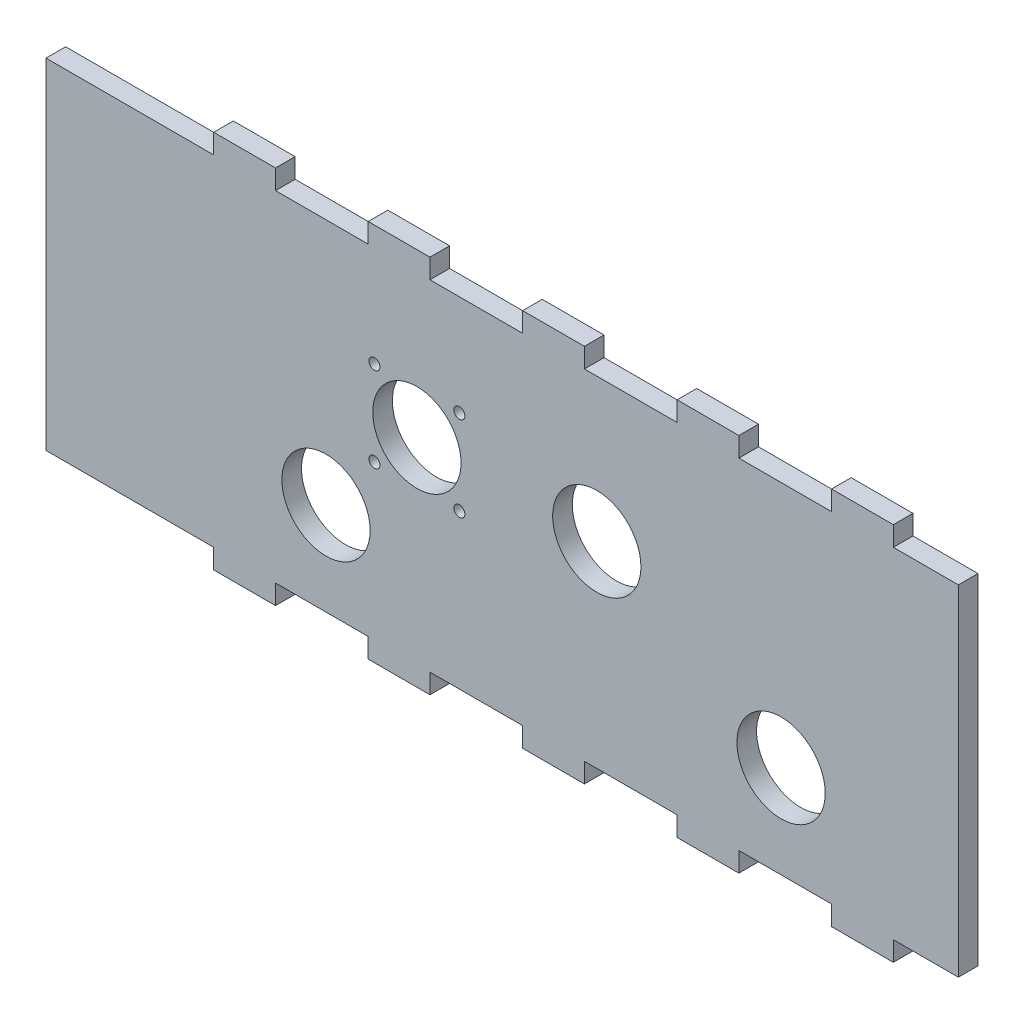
ISO-10303-21;
HEADER;
FILE_DESCRIPTION(('STEP AP214'),'2;1');
FILE_NAME('part.step','',(''),(''),'','','');
FILE_SCHEMA(('AUTOMOTIVE_DESIGN { 1 0 10303 214 1 1 1 1 }'));
ENDSEC;
DATA;
#1=APPLICATION_CONTEXT('core data for automotive mechanical design processes');
#2=APPLICATION_PROTOCOL_DEFINITION('international standard','automotive_design',2000,#1);
#3=PRODUCT_CONTEXT('',#1,'mechanical');
#4=PRODUCT('Part','Part','',(#3));
#5=PRODUCT_RELATED_PRODUCT_CATEGORY('part','',(#4));
#6=PRODUCT_DEFINITION_FORMATION('','',#4);
#7=PRODUCT_DEFINITION_CONTEXT('part definition',#1,'design');
#8=PRODUCT_DEFINITION('design','',#6,#7);
#9=PRODUCT_DEFINITION_SHAPE('','',#8);
#10=(LENGTH_UNIT() NAMED_UNIT(*) SI_UNIT(.MILLI.,.METRE.));
#11=(NAMED_UNIT(*) PLANE_ANGLE_UNIT() SI_UNIT($,.RADIAN.));
#12=(NAMED_UNIT(*) SI_UNIT($,.STERADIAN.) SOLID_ANGLE_UNIT());
#13=UNCERTAINTY_MEASURE_WITH_UNIT(LENGTH_MEASURE(1.E-05),#10,'distance_accuracy_value','');
#14=(GEOMETRIC_REPRESENTATION_CONTEXT(3) GLOBAL_UNCERTAINTY_ASSIGNED_CONTEXT((#13)) GLOBAL_UNIT_ASSIGNED_CONTEXT((#10,
#11,#12)) REPRESENTATION_CONTEXT('',''));
#15=CARTESIAN_POINT('',(0.,0.,0.));
#16=DIRECTION('',(0.,0.,1.));
#17=DIRECTION('',(1.,0.,0.));
#18=AXIS2_PLACEMENT_3D('',#15,#16,#17);
#19=CARTESIAN_POINT('',(0.,0.,6.35));
#20=DIRECTION('',(0.,0.,1.));
#21=DIRECTION('',(1.,0.,0.));
#22=AXIS2_PLACEMENT_3D('',#19,#20,#21);
#23=PLANE('',#22);
#24=CARTESIAN_POINT('',(133.815146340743,77.4191586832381,6.35));
#25=DIRECTION('',(0.,0.,1.));
#26=DIRECTION('',(1.,0.,0.));
#27=AXIS2_PLACEMENT_3D('',#24,#25,#26);
#28=CIRCLE('',#27,1.778);
#29=CARTESIAN_POINT('',(135.593146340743,77.4191586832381,6.35));
#30=VERTEX_POINT('',#29);
#31=EDGE_CURVE('E729',#30,#30,#28,.T.);
#32=ORIENTED_EDGE('',*,*,#31,.F.);
#33=EDGE_LOOP('',(#32));
#34=FACE_BOUND('',#33,.T.);
#35=CARTESIAN_POINT('',(106.317602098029,77.4191586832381,6.35));
#36=DIRECTION('',(0.,0.,1.));
#37=DIRECTION('',(1.,0.,0.));
#38=AXIS2_PLACEMENT_3D('',#35,#36,#37);
#39=CIRCLE('',#38,1.778);
#40=CARTESIAN_POINT('',(108.095602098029,77.4191586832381,6.35));
#41=VERTEX_POINT('',#40);
#42=EDGE_CURVE('E741',#41,#41,#39,.T.);
#43=ORIENTED_EDGE('',*,*,#42,.F.);
#44=EDGE_LOOP('',(#43));
#45=FACE_BOUND('',#44,.T.);
#46=CARTESIAN_POINT('',(178.306374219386,63.6703865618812,6.35));
#47=DIRECTION('',(0.,0.,1.));
#48=DIRECTION('',(1.,0.,0.));
#49=AXIS2_PLACEMENT_3D('',#46,#47,#48);
#50=CIRCLE('',#49,14.2875);
#51=CARTESIAN_POINT('',(192.593874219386,63.6703865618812,6.35));
#52=VERTEX_POINT('',#51);
#53=EDGE_CURVE('E753',#52,#52,#50,.T.);
#54=ORIENTED_EDGE('',*,*,#53,.F.);
#55=EDGE_LOOP('',(#54));
#56=FACE_BOUND('',#55,.T.);
#57=CARTESIAN_POINT('',(90.64,30.,6.35));
#58=DIRECTION('',(0.,0.,1.));
#59=DIRECTION('',(1.,0.,0.));
#60=AXIS2_PLACEMENT_3D('',#57,#58,#59);
#61=CIRCLE('',#60,14.2875);
#62=CARTESIAN_POINT('',(104.9275,30.,6.35));
#63=VERTEX_POINT('',#62);
#64=EDGE_CURVE('E356',#63,#63,#61,.T.);
#65=ORIENTED_EDGE('',*,*,#64,.F.);
#66=EDGE_LOOP('',(#65));
#67=FACE_BOUND('',#66,.T.);
#68=DIRECTION('',(1.,0.,0.));
#69=VECTOR('',#68,1.);
#70=CARTESIAN_POINT('',(54.3,0.,6.35));
#71=LINE('',#70,#69);
#72=CARTESIAN_POINT('',(0.,0.,6.35));
#73=VERTEX_POINT('',#72);
#74=CARTESIAN_POINT('',(54.3,0.,6.35));
#75=VERTEX_POINT('',#74);
#76=EDGE_CURVE('E439',#73,#75,#71,.T.);
#77=ORIENTED_EDGE('',*,*,#76,.T.);
#78=DIRECTION('',(0.,-1.,0.));
#79=VECTOR('',#78,1.);
#80=CARTESIAN_POINT('',(54.3,-6.35,6.35));
#81=LINE('',#80,#79);
#82=CARTESIAN_POINT('',(54.3,-6.35,6.35));
#83=VERTEX_POINT('',#82);
#84=EDGE_CURVE('E207',#75,#83,#81,.T.);
#85=ORIENTED_EDGE('',*,*,#84,.T.);
#86=DIRECTION('',(1.,0.,0.));
#87=VECTOR('',#86,1.);
#88=CARTESIAN_POINT('',(74.3,-6.35,6.35));
#89=LINE('',#88,#87);
#90=CARTESIAN_POINT('',(74.3,-6.35,6.35));
#91=VERTEX_POINT('',#90);
#92=EDGE_CURVE('E562',#83,#91,#89,.T.);
#93=ORIENTED_EDGE('',*,*,#92,.T.);
#94=DIRECTION('',(0.,1.,0.));
#95=VECTOR('',#94,1.);
#96=CARTESIAN_POINT('',(74.3000000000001,0.,6.35));
#97=LINE('',#96,#95);
#98=CARTESIAN_POINT('',(74.3000000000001,0.,6.35));
#99=VERTEX_POINT('',#98);
#100=EDGE_CURVE('E581',#91,#99,#97,.T.);
#101=ORIENTED_EDGE('',*,*,#100,.T.);
#102=DIRECTION('',(1.,0.,0.));
#103=VECTOR('',#102,1.);
#104=CARTESIAN_POINT('',(104.3,0.,6.35));
#105=LINE('',#104,#103);
#106=CARTESIAN_POINT('',(104.3,0.,6.35));
#107=VERTEX_POINT('',#106);
#108=EDGE_CURVE('E578',#99,#107,#105,.T.);
#109=ORIENTED_EDGE('',*,*,#108,.T.);
#110=DIRECTION('',(0.,-1.,0.));
#111=VECTOR('',#110,1.);
#112=CARTESIAN_POINT('',(104.3,-6.34999999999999,6.35));
#113=LINE('',#112,#111);
#114=CARTESIAN_POINT('',(104.3,-6.34999999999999,6.35));
#115=VERTEX_POINT('',#114);
#116=EDGE_CURVE('E580',#107,#115,#113,.T.);
#117=ORIENTED_EDGE('',*,*,#116,.T.);
#118=DIRECTION('',(1.,0.,0.));
#119=VECTOR('',#118,1.);
#120=CARTESIAN_POINT('',(124.3,-6.34999999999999,6.35));
#121=LINE('',#120,#119);
#122=CARTESIAN_POINT('',(124.3,-6.34999999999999,6.35));
#123=VERTEX_POINT('',#122);
#124=EDGE_CURVE('E583',#115,#123,#121,.T.);
#125=ORIENTED_EDGE('',*,*,#124,.T.);
#126=DIRECTION('',(0.,1.,0.));
#127=VECTOR('',#126,1.);
#128=CARTESIAN_POINT('',(124.3,0.,6.35));
#129=LINE('',#128,#127);
#130=CARTESIAN_POINT('',(124.3,0.,6.35));
#131=VERTEX_POINT('',#130);
#132=EDGE_CURVE('E589',#123,#131,#129,.T.);
#133=ORIENTED_EDGE('',*,*,#132,.T.);
#134=DIRECTION('',(1.,0.,0.));
#135=VECTOR('',#134,1.);
#136=CARTESIAN_POINT('',(154.3,0.,6.35));
#137=LINE('',#136,#135);
#138=CARTESIAN_POINT('',(154.3,0.,6.35));
#139=VERTEX_POINT('',#138);
#140=EDGE_CURVE('E591',#131,#139,#137,.T.);
#141=ORIENTED_EDGE('',*,*,#140,.T.);
#142=DIRECTION('',(0.,-1.,0.));
#143=VECTOR('',#142,1.);
#144=CARTESIAN_POINT('',(154.3,0.,6.35));
#145=LINE('',#144,#143);
#146=CARTESIAN_POINT('',(154.3,-6.34999999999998,6.35));
#147=VERTEX_POINT('',#146);
#148=EDGE_CURVE('E593',#139,#147,#145,.T.);
#149=ORIENTED_EDGE('',*,*,#148,.T.);
#150=DIRECTION('',(1.,0.,0.));
#151=VECTOR('',#150,1.);
#152=CARTESIAN_POINT('',(154.3,-6.34999999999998,6.35));
#153=LINE('',#152,#151);
#154=CARTESIAN_POINT('',(174.3,-6.34999999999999,6.35));
#155=VERTEX_POINT('',#154);
#156=EDGE_CURVE('E595',#147,#155,#153,.T.);
#157=ORIENTED_EDGE('',*,*,#156,.T.);
#158=DIRECTION('',(0.,1.,0.));
#159=VECTOR('',#158,1.);
#160=CARTESIAN_POINT('',(174.3,-6.34999999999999,6.35));
#161=LINE('',#160,#159);
#162=CARTESIAN_POINT('',(174.3,0.,6.35));
#163=VERTEX_POINT('',#162);
#164=EDGE_CURVE('E597',#155,#163,#161,.T.);
#165=ORIENTED_EDGE('',*,*,#164,.T.);
#166=DIRECTION('',(1.,0.,0.));
#167=VECTOR('',#166,1.);
#168=CARTESIAN_POINT('',(174.3,0.,6.35));
#169=LINE('',#168,#167);
#170=CARTESIAN_POINT('',(204.3,0.,6.35));
#171=VERTEX_POINT('',#170);
#172=EDGE_CURVE('E599',#163,#171,#169,.T.);
#173=ORIENTED_EDGE('',*,*,#172,.T.);
#174=DIRECTION('',(0.,-1.,0.));
#175=VECTOR('',#174,1.);
#176=CARTESIAN_POINT('',(204.3,0.,6.35));
#177=LINE('',#176,#175);
#178=CARTESIAN_POINT('',(204.3,-6.34999999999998,6.35));
#179=VERTEX_POINT('',#178);
#180=EDGE_CURVE('E601',#171,#179,#177,.T.);
#181=ORIENTED_EDGE('',*,*,#180,.T.);
#182=DIRECTION('',(1.,0.,0.));
#183=VECTOR('',#182,1.);
#184=CARTESIAN_POINT('',(204.3,-6.34999999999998,6.35));
#185=LINE('',#184,#183);
#186=CARTESIAN_POINT('',(224.3,-6.34999999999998,6.35));
#187=VERTEX_POINT('',#186);
#188=EDGE_CURVE('E603',#179,#187,#185,.T.);
#189=ORIENTED_EDGE('',*,*,#188,.T.);
#190=DIRECTION('',(0.,1.,0.));
#191=VECTOR('',#190,1.);
#192=CARTESIAN_POINT('',(224.3,-6.34999999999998,6.35));
#193=LINE('',#192,#191);
#194=CARTESIAN_POINT('',(224.3,0.,6.35));
#195=VERTEX_POINT('',#194);
#196=EDGE_CURVE('E605',#187,#195,#193,.T.);
#197=ORIENTED_EDGE('',*,*,#196,.T.);
#198=DIRECTION('',(1.,0.,0.));
#199=VECTOR('',#198,1.);
#200=CARTESIAN_POINT('',(224.3,0.,6.35));
#201=LINE('',#200,#199);
#202=CARTESIAN_POINT('',(254.3,0.,6.35));
#203=VERTEX_POINT('',#202);
#204=EDGE_CURVE('E607',#195,#203,#201,.T.);
#205=ORIENTED_EDGE('',*,*,#204,.T.);
#206=DIRECTION('',(0.,-1.,0.));
#207=VECTOR('',#206,1.);
#208=CARTESIAN_POINT('',(254.3,0.,6.35));
#209=LINE('',#208,#207);
#210=CARTESIAN_POINT('',(254.3,-6.34999999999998,6.35));
#211=VERTEX_POINT('',#210);
#212=EDGE_CURVE('E609',#203,#211,#209,.T.);
#213=ORIENTED_EDGE('',*,*,#212,.T.);
#214=DIRECTION('',(1.,0.,0.));
#215=VECTOR('',#214,1.);
#216=CARTESIAN_POINT('',(254.3,-6.34999999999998,6.35));
#217=LINE('',#216,#215);
#218=CARTESIAN_POINT('',(274.3,-6.34999999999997,6.35));
#219=VERTEX_POINT('',#218);
#220=EDGE_CURVE('E611',#211,#219,#217,.T.);
#221=ORIENTED_EDGE('',*,*,#220,.T.);
#222=DIRECTION('',(0.,1.,0.));
#223=VECTOR('',#222,1.);
#224=CARTESIAN_POINT('',(274.3,-6.34999999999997,6.35));
#225=LINE('',#224,#223);
#226=CARTESIAN_POINT('',(274.3,0.,6.35));
#227=VERTEX_POINT('',#226);
#228=EDGE_CURVE('E613',#219,#227,#225,.T.);
#229=ORIENTED_EDGE('',*,*,#228,.T.);
#230=DIRECTION('',(1.,0.,0.));
#231=VECTOR('',#230,1.);
#232=CARTESIAN_POINT('',(274.3,0.,6.35));
#233=LINE('',#232,#231);
#234=CARTESIAN_POINT('',(295.36,0.,6.35));
#235=VERTEX_POINT('',#234);
#236=EDGE_CURVE('E615',#227,#235,#233,.T.);
#237=ORIENTED_EDGE('',*,*,#236,.T.);
#238=DIRECTION('',(0.,1.,0.));
#239=VECTOR('',#238,1.);
#240=CARTESIAN_POINT('',(295.36,110.,6.35));
#241=LINE('',#240,#239);
#242=CARTESIAN_POINT('',(295.36,110.,6.35));
#243=VERTEX_POINT('',#242);
#244=EDGE_CURVE('E617',#235,#243,#241,.T.);
#245=ORIENTED_EDGE('',*,*,#244,.T.);
#246=DIRECTION('',(-1.,0.,0.));
#247=VECTOR('',#246,1.);
#248=CARTESIAN_POINT('',(274.3,110.,6.35));
#249=LINE('',#248,#247);
#250=CARTESIAN_POINT('',(274.3,110.,6.35));
#251=VERTEX_POINT('',#250);
#252=EDGE_CURVE('E619',#243,#251,#249,.T.);
#253=ORIENTED_EDGE('',*,*,#252,.T.);
#254=DIRECTION('',(0.,1.,0.));
#255=VECTOR('',#254,1.);
#256=CARTESIAN_POINT('',(274.3,116.35,6.35));
#257=LINE('',#256,#255);
#258=CARTESIAN_POINT('',(274.3,116.35,6.35));
#259=VERTEX_POINT('',#258);
#260=EDGE_CURVE('E621',#251,#259,#257,.T.);
#261=ORIENTED_EDGE('',*,*,#260,.T.);
#262=DIRECTION('',(-1.,0.,0.));
#263=VECTOR('',#262,1.);
#264=CARTESIAN_POINT('',(254.3,116.35,6.35));
#265=LINE('',#264,#263);
#266=CARTESIAN_POINT('',(254.3,116.35,6.35));
#267=VERTEX_POINT('',#266);
#268=EDGE_CURVE('E623',#259,#267,#265,.T.);
#269=ORIENTED_EDGE('',*,*,#268,.T.);
#270=DIRECTION('',(0.,-1.,0.));
#271=VECTOR('',#270,1.);
#272=CARTESIAN_POINT('',(254.3,110.,6.35));
#273=LINE('',#272,#271);
#274=CARTESIAN_POINT('',(254.3,110.,6.35));
#275=VERTEX_POINT('',#274);
#276=EDGE_CURVE('E625',#267,#275,#273,.T.);
#277=ORIENTED_EDGE('',*,*,#276,.T.);
#278=DIRECTION('',(-1.,0.,0.));
#279=VECTOR('',#278,1.);
#280=CARTESIAN_POINT('',(224.3,110.,6.35));
#281=LINE('',#280,#279);
#282=CARTESIAN_POINT('',(224.3,110.,6.35));
#283=VERTEX_POINT('',#282);
#284=EDGE_CURVE('E627',#275,#283,#281,.T.);
#285=ORIENTED_EDGE('',*,*,#284,.T.);
#286=DIRECTION('',(0.,1.,0.));
#287=VECTOR('',#286,1.);
#288=CARTESIAN_POINT('',(224.3,116.35,6.35));
#289=LINE('',#288,#287);
#290=CARTESIAN_POINT('',(224.3,116.35,6.35));
#291=VERTEX_POINT('',#290);
#292=EDGE_CURVE('E629',#283,#291,#289,.T.);
#293=ORIENTED_EDGE('',*,*,#292,.T.);
#294=DIRECTION('',(-1.,0.,0.));
#295=VECTOR('',#294,1.);
#296=CARTESIAN_POINT('',(204.3,116.35,6.35));
#297=LINE('',#296,#295);
#298=CARTESIAN_POINT('',(204.3,116.35,6.35));
#299=VERTEX_POINT('',#298);
#300=EDGE_CURVE('E631',#291,#299,#297,.T.);
#301=ORIENTED_EDGE('',*,*,#300,.T.);
#302=DIRECTION('',(0.,-1.,0.));
#303=VECTOR('',#302,1.);
#304=CARTESIAN_POINT('',(204.3,110.,6.35));
#305=LINE('',#304,#303);
#306=CARTESIAN_POINT('',(204.3,110.,6.35));
#307=VERTEX_POINT('',#306);
#308=EDGE_CURVE('E633',#299,#307,#305,.T.);
#309=ORIENTED_EDGE('',*,*,#308,.T.);
#310=DIRECTION('',(-1.,0.,0.));
#311=VECTOR('',#310,1.);
#312=CARTESIAN_POINT('',(174.3,110.,6.35));
#313=LINE('',#312,#311);
#314=CARTESIAN_POINT('',(174.3,110.,6.35));
#315=VERTEX_POINT('',#314);
#316=EDGE_CURVE('E635',#307,#315,#313,.T.);
#317=ORIENTED_EDGE('',*,*,#316,.T.);
#318=DIRECTION('',(0.,1.,0.));
#319=VECTOR('',#318,1.);
#320=CARTESIAN_POINT('',(174.3,116.35,6.35));
#321=LINE('',#320,#319);
#322=CARTESIAN_POINT('',(174.3,116.35,6.35));
#323=VERTEX_POINT('',#322);
#324=EDGE_CURVE('E637',#315,#323,#321,.T.);
#325=ORIENTED_EDGE('',*,*,#324,.T.);
#326=DIRECTION('',(-1.,0.,0.));
#327=VECTOR('',#326,1.);
#328=CARTESIAN_POINT('',(154.3,116.35,6.35));
#329=LINE('',#328,#327);
#330=CARTESIAN_POINT('',(154.3,116.35,6.35));
#331=VERTEX_POINT('',#330);
#332=EDGE_CURVE('E639',#323,#331,#329,.T.);
#333=ORIENTED_EDGE('',*,*,#332,.T.);
#334=DIRECTION('',(0.,-1.,0.));
#335=VECTOR('',#334,1.);
#336=CARTESIAN_POINT('',(154.3,110.,6.35));
#337=LINE('',#336,#335);
#338=CARTESIAN_POINT('',(154.3,110.,6.35));
#339=VERTEX_POINT('',#338);
#340=EDGE_CURVE('E641',#331,#339,#337,.T.);
#341=ORIENTED_EDGE('',*,*,#340,.T.);
#342=DIRECTION('',(-1.,0.,0.));
#343=VECTOR('',#342,1.);
#344=CARTESIAN_POINT('',(154.3,110.,6.35));
#345=LINE('',#344,#343);
#346=CARTESIAN_POINT('',(124.3,110.,6.35));
#347=VERTEX_POINT('',#346);
#348=EDGE_CURVE('E643',#339,#347,#345,.T.);
#349=ORIENTED_EDGE('',*,*,#348,.T.);
#350=DIRECTION('',(0.,1.,0.));
#351=VECTOR('',#350,1.);
#352=CARTESIAN_POINT('',(124.3,110.,6.35));
#353=LINE('',#352,#351);
#354=CARTESIAN_POINT('',(124.3,116.35,6.35));
#355=VERTEX_POINT('',#354);
#356=EDGE_CURVE('E645',#347,#355,#353,.T.);
#357=ORIENTED_EDGE('',*,*,#356,.T.);
#358=DIRECTION('',(-1.,0.,0.));
#359=VECTOR('',#358,1.);
#360=CARTESIAN_POINT('',(124.3,116.35,6.35));
#361=LINE('',#360,#359);
#362=CARTESIAN_POINT('',(104.3,116.35,6.35));
#363=VERTEX_POINT('',#362);
#364=EDGE_CURVE('E647',#355,#363,#361,.T.);
#365=ORIENTED_EDGE('',*,*,#364,.T.);
#366=DIRECTION('',(0.,-1.,0.));
#367=VECTOR('',#366,1.);
#368=CARTESIAN_POINT('',(104.3,116.35,6.35));
#369=LINE('',#368,#367);
#370=CARTESIAN_POINT('',(104.3,110.,6.35));
#371=VERTEX_POINT('',#370);
#372=EDGE_CURVE('E649',#363,#371,#369,.T.);
#373=ORIENTED_EDGE('',*,*,#372,.T.);
#374=DIRECTION('',(-1.,0.,0.));
#375=VECTOR('',#374,1.);
#376=CARTESIAN_POINT('',(104.3,110.,6.35));
#377=LINE('',#376,#375);
#378=CARTESIAN_POINT('',(74.3000000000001,110.,6.35));
#379=VERTEX_POINT('',#378);
#380=EDGE_CURVE('E651',#371,#379,#377,.T.);
#381=ORIENTED_EDGE('',*,*,#380,.T.);
#382=DIRECTION('',(0.,1.,0.));
#383=VECTOR('',#382,1.);
#384=CARTESIAN_POINT('',(74.3000000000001,110.,6.35));
#385=LINE('',#384,#383);
#386=CARTESIAN_POINT('',(74.3,116.35,6.35));
#387=VERTEX_POINT('',#386);
#388=EDGE_CURVE('E653',#379,#387,#385,.T.);
#389=ORIENTED_EDGE('',*,*,#388,.T.);
#390=DIRECTION('',(-1.,0.,0.));
#391=VECTOR('',#390,1.);
#392=CARTESIAN_POINT('',(74.3,116.35,6.35));
#393=LINE('',#392,#391);
#394=CARTESIAN_POINT('',(54.3,116.35,6.35));
#395=VERTEX_POINT('',#394);
#396=EDGE_CURVE('E334',#387,#395,#393,.T.);
#397=ORIENTED_EDGE('',*,*,#396,.T.);
#398=DIRECTION('',(0.,-1.,0.));
#399=VECTOR('',#398,1.);
#400=CARTESIAN_POINT('',(54.3,116.35,6.35));
#401=LINE('',#400,#399);
#402=CARTESIAN_POINT('',(54.2999999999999,110.,6.35));
#403=VERTEX_POINT('',#402);
#404=EDGE_CURVE('E328',#395,#403,#401,.T.);
#405=ORIENTED_EDGE('',*,*,#404,.T.);
#406=DIRECTION('',(-1.,0.,0.));
#407=VECTOR('',#406,1.);
#408=CARTESIAN_POINT('',(54.2999999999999,110.,6.35));
#409=LINE('',#408,#407);
#410=CARTESIAN_POINT('',(0.,110.,6.35));
#411=VERTEX_POINT('',#410);
#412=EDGE_CURVE('E332',#403,#411,#409,.T.);
#413=ORIENTED_EDGE('',*,*,#412,.T.);
#414=DIRECTION('',(0.,-1.,0.));
#415=VECTOR('',#414,1.);
#416=CARTESIAN_POINT('',(0.,110.,6.35));
#417=LINE('',#416,#415);
#418=EDGE_CURVE('E56',#411,#73,#417,.T.);
#419=ORIENTED_EDGE('',*,*,#418,.T.);
#420=EDGE_LOOP('',(#77,#85,#93,#101,#109,#117,#125,#133,#141,#149,#157,#165,#173,#181,#189,#197,
#205,#213,#221,#229,#237,#245,#253,#261,#269,#277,#285,#293,#301,#309,#317,#325,#333,#341,#349,
#357,#365,#373,#381,#389,#397,#405,#413,#419));
#421=FACE_BOUND('',#420,.T.);
#422=CARTESIAN_POINT('',(237.96,30.,6.35));
#423=DIRECTION('',(0.,0.,1.));
#424=DIRECTION('',(1.,0.,0.));
#425=AXIS2_PLACEMENT_3D('',#422,#423,#424);
#426=CIRCLE('',#425,14.2875);
#427=CARTESIAN_POINT('',(252.2475,30.,6.35));
#428=VERTEX_POINT('',#427);
#429=EDGE_CURVE('E759',#428,#428,#426,.T.);
#430=ORIENTED_EDGE('',*,*,#429,.F.);
#431=EDGE_LOOP('',(#430));
#432=FACE_BOUND('',#431,.T.);
#433=CARTESIAN_POINT('',(120.066374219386,63.6703865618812,6.35));
#434=DIRECTION('',(0.,0.,1.));
#435=DIRECTION('',(1.,0.,0.));
#436=AXIS2_PLACEMENT_3D('',#433,#434,#435);
#437=CIRCLE('',#436,14.2875);
#438=CARTESIAN_POINT('',(134.353874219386,63.6703865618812,6.35));
#439=VERTEX_POINT('',#438);
#440=EDGE_CURVE('E747',#439,#439,#437,.T.);
#441=ORIENTED_EDGE('',*,*,#440,.F.);
#442=EDGE_LOOP('',(#441));
#443=FACE_BOUND('',#442,.T.);
#444=CARTESIAN_POINT('',(106.317602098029,49.9216144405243,6.35));
#445=DIRECTION('',(0.,0.,1.));
#446=DIRECTION('',(1.,0.,0.));
#447=AXIS2_PLACEMENT_3D('',#444,#445,#446);
#448=CIRCLE('',#447,1.77800000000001);
#449=CARTESIAN_POINT('',(108.095602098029,49.9216144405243,6.35));
#450=VERTEX_POINT('',#449);
#451=EDGE_CURVE('E735',#450,#450,#448,.T.);
#452=ORIENTED_EDGE('',*,*,#451,.F.);
#453=EDGE_LOOP('',(#452));
#454=FACE_BOUND('',#453,.T.);
#455=CARTESIAN_POINT('',(133.815146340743,49.9216144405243,6.35));
#456=DIRECTION('',(0.,0.,1.));
#457=DIRECTION('',(1.,0.,0.));
#458=AXIS2_PLACEMENT_3D('',#455,#456,#457);
#459=CIRCLE('',#458,1.77800000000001);
#460=CARTESIAN_POINT('',(135.593146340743,49.9216144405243,6.35));
#461=VERTEX_POINT('',#460);
#462=EDGE_CURVE('E720',#461,#461,#459,.T.);
#463=ORIENTED_EDGE('',*,*,#462,.F.);
#464=EDGE_LOOP('',(#463));
#465=FACE_BOUND('',#464,.T.);
#466=ADVANCED_FACE('F39',(#34,#45,#56,#67,#421,#432,#443,#454,#465),#23,.T.);
#467=CARTESIAN_POINT('',(0.,0.,0.));
#468=DIRECTION('',(0.,0.,1.));
#469=DIRECTION('',(1.,0.,0.));
#470=AXIS2_PLACEMENT_3D('',#467,#468,#469);
#471=PLANE('',#470);
#472=DIRECTION('',(1.,0.,0.));
#473=VECTOR('',#472,1.);
#474=CARTESIAN_POINT('',(54.3,0.,0.));
#475=LINE('',#474,#473);
#476=CARTESIAN_POINT('',(0.,0.,0.));
#477=VERTEX_POINT('',#476);
#478=CARTESIAN_POINT('',(54.3,0.,0.));
#479=VERTEX_POINT('',#478);
#480=EDGE_CURVE('E352',#477,#479,#475,.T.);
#481=ORIENTED_EDGE('',*,*,#480,.F.);
#482=DIRECTION('',(0.,-1.,0.));
#483=VECTOR('',#482,1.);
#484=CARTESIAN_POINT('',(0.,110.,0.));
#485=LINE('',#484,#483);
#486=CARTESIAN_POINT('',(0.,110.,0.));
#487=VERTEX_POINT('',#486);
#488=EDGE_CURVE('E199',#487,#477,#485,.T.);
#489=ORIENTED_EDGE('',*,*,#488,.F.);
#490=DIRECTION('',(-1.,0.,0.));
#491=VECTOR('',#490,1.);
#492=CARTESIAN_POINT('',(54.2999999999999,110.,0.));
#493=LINE('',#492,#491);
#494=CARTESIAN_POINT('',(54.2999999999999,110.,0.));
#495=VERTEX_POINT('',#494);
#496=EDGE_CURVE('E193',#495,#487,#493,.T.);
#497=ORIENTED_EDGE('',*,*,#496,.F.);
#498=DIRECTION('',(0.,-1.,0.));
#499=VECTOR('',#498,1.);
#500=CARTESIAN_POINT('',(54.3,116.35,0.));
#501=LINE('',#500,#499);
#502=CARTESIAN_POINT('',(54.3,116.35,0.));
#503=VERTEX_POINT('',#502);
#504=EDGE_CURVE('E342',#503,#495,#501,.T.);
#505=ORIENTED_EDGE('',*,*,#504,.F.);
#506=DIRECTION('',(-1.,0.,0.));
#507=VECTOR('',#506,1.);
#508=CARTESIAN_POINT('',(74.3,116.35,0.));
#509=LINE('',#508,#507);
#510=CARTESIAN_POINT('',(74.3,116.35,0.));
#511=VERTEX_POINT('',#510);
#512=EDGE_CURVE('E434',#511,#503,#509,.T.);
#513=ORIENTED_EDGE('',*,*,#512,.F.);
#514=DIRECTION('',(0.,1.,0.));
#515=VECTOR('',#514,1.);
#516=CARTESIAN_POINT('',(74.3000000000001,110.,0.));
#517=LINE('',#516,#515);
#518=CARTESIAN_POINT('',(74.3000000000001,110.,0.));
#519=VERTEX_POINT('',#518);
#520=EDGE_CURVE('E432',#519,#511,#517,.T.);
#521=ORIENTED_EDGE('',*,*,#520,.F.);
#522=DIRECTION('',(-1.,0.,0.));
#523=VECTOR('',#522,1.);
#524=CARTESIAN_POINT('',(104.3,110.,0.));
#525=LINE('',#524,#523);
#526=CARTESIAN_POINT('',(104.3,110.,0.));
#527=VERTEX_POINT('',#526);
#528=EDGE_CURVE('E430',#527,#519,#525,.T.);
#529=ORIENTED_EDGE('',*,*,#528,.F.);
#530=DIRECTION('',(0.,-1.,0.));
#531=VECTOR('',#530,1.);
#532=CARTESIAN_POINT('',(104.3,116.35,0.));
#533=LINE('',#532,#531);
#534=CARTESIAN_POINT('',(104.3,116.35,0.));
#535=VERTEX_POINT('',#534);
#536=EDGE_CURVE('E428',#535,#527,#533,.T.);
#537=ORIENTED_EDGE('',*,*,#536,.F.);
#538=DIRECTION('',(-1.,0.,0.));
#539=VECTOR('',#538,1.);
#540=CARTESIAN_POINT('',(124.3,116.35,0.));
#541=LINE('',#540,#539);
#542=CARTESIAN_POINT('',(124.3,116.35,0.));
#543=VERTEX_POINT('',#542);
#544=EDGE_CURVE('E426',#543,#535,#541,.T.);
#545=ORIENTED_EDGE('',*,*,#544,.F.);
#546=DIRECTION('',(0.,1.,0.));
#547=VECTOR('',#546,1.);
#548=CARTESIAN_POINT('',(124.3,110.,0.));
#549=LINE('',#548,#547);
#550=CARTESIAN_POINT('',(124.3,110.,0.));
#551=VERTEX_POINT('',#550);
#552=EDGE_CURVE('E424',#551,#543,#549,.T.);
#553=ORIENTED_EDGE('',*,*,#552,.F.);
#554=DIRECTION('',(-1.,0.,0.));
#555=VECTOR('',#554,1.);
#556=CARTESIAN_POINT('',(154.3,110.,0.));
#557=LINE('',#556,#555);
#558=CARTESIAN_POINT('',(154.3,110.,0.));
#559=VERTEX_POINT('',#558);
#560=EDGE_CURVE('E422',#559,#551,#557,.T.);
#561=ORIENTED_EDGE('',*,*,#560,.F.);
#562=DIRECTION('',(0.,-1.,0.));
#563=VECTOR('',#562,1.);
#564=CARTESIAN_POINT('',(154.3,110.,0.));
#565=LINE('',#564,#563);
#566=CARTESIAN_POINT('',(154.3,116.35,0.));
#567=VERTEX_POINT('',#566);
#568=EDGE_CURVE('E420',#567,#559,#565,.T.);
#569=ORIENTED_EDGE('',*,*,#568,.F.);
#570=DIRECTION('',(-1.,0.,0.));
#571=VECTOR('',#570,1.);
#572=CARTESIAN_POINT('',(154.3,116.35,0.));
#573=LINE('',#572,#571);
#574=CARTESIAN_POINT('',(174.3,116.35,0.));
#575=VERTEX_POINT('',#574);
#576=EDGE_CURVE('E418',#575,#567,#573,.T.);
#577=ORIENTED_EDGE('',*,*,#576,.F.);
#578=DIRECTION('',(0.,1.,0.));
#579=VECTOR('',#578,1.);
#580=CARTESIAN_POINT('',(174.3,116.35,0.));
#581=LINE('',#580,#579);
#582=CARTESIAN_POINT('',(174.3,110.,0.));
#583=VERTEX_POINT('',#582);
#584=EDGE_CURVE('E416',#583,#575,#581,.T.);
#585=ORIENTED_EDGE('',*,*,#584,.F.);
#586=DIRECTION('',(-1.,0.,0.));
#587=VECTOR('',#586,1.);
#588=CARTESIAN_POINT('',(174.3,110.,0.));
#589=LINE('',#588,#587);
#590=CARTESIAN_POINT('',(204.3,110.,0.));
#591=VERTEX_POINT('',#590);
#592=EDGE_CURVE('E414',#591,#583,#589,.T.);
#593=ORIENTED_EDGE('',*,*,#592,.F.);
#594=DIRECTION('',(0.,-1.,0.));
#595=VECTOR('',#594,1.);
#596=CARTESIAN_POINT('',(204.3,110.,0.));
#597=LINE('',#596,#595);
#598=CARTESIAN_POINT('',(204.3,116.35,0.));
#599=VERTEX_POINT('',#598);
#600=EDGE_CURVE('E412',#599,#591,#597,.T.);
#601=ORIENTED_EDGE('',*,*,#600,.F.);
#602=DIRECTION('',(-1.,0.,0.));
#603=VECTOR('',#602,1.);
#604=CARTESIAN_POINT('',(204.3,116.35,0.));
#605=LINE('',#604,#603);
#606=CARTESIAN_POINT('',(224.3,116.35,0.));
#607=VERTEX_POINT('',#606);
#608=EDGE_CURVE('E410',#607,#599,#605,.T.);
#609=ORIENTED_EDGE('',*,*,#608,.F.);
#610=DIRECTION('',(0.,1.,0.));
#611=VECTOR('',#610,1.);
#612=CARTESIAN_POINT('',(224.3,116.35,0.));
#613=LINE('',#612,#611);
#614=CARTESIAN_POINT('',(224.3,110.,0.));
#615=VERTEX_POINT('',#614);
#616=EDGE_CURVE('E408',#615,#607,#613,.T.);
#617=ORIENTED_EDGE('',*,*,#616,.F.);
#618=DIRECTION('',(-1.,0.,0.));
#619=VECTOR('',#618,1.);
#620=CARTESIAN_POINT('',(224.3,110.,0.));
#621=LINE('',#620,#619);
#622=CARTESIAN_POINT('',(254.3,110.,0.));
#623=VERTEX_POINT('',#622);
#624=EDGE_CURVE('E406',#623,#615,#621,.T.);
#625=ORIENTED_EDGE('',*,*,#624,.F.);
#626=DIRECTION('',(0.,-1.,0.));
#627=VECTOR('',#626,1.);
#628=CARTESIAN_POINT('',(254.3,110.,0.));
#629=LINE('',#628,#627);
#630=CARTESIAN_POINT('',(254.3,116.35,0.));
#631=VERTEX_POINT('',#630);
#632=EDGE_CURVE('E404',#631,#623,#629,.T.);
#633=ORIENTED_EDGE('',*,*,#632,.F.);
#634=DIRECTION('',(-1.,0.,0.));
#635=VECTOR('',#634,1.);
#636=CARTESIAN_POINT('',(254.3,116.35,0.));
#637=LINE('',#636,#635);
#638=CARTESIAN_POINT('',(274.3,116.35,0.));
#639=VERTEX_POINT('',#638);
#640=EDGE_CURVE('E402',#639,#631,#637,.T.);
#641=ORIENTED_EDGE('',*,*,#640,.F.);
#642=DIRECTION('',(0.,1.,0.));
#643=VECTOR('',#642,1.);
#644=CARTESIAN_POINT('',(274.3,116.35,0.));
#645=LINE('',#644,#643);
#646=CARTESIAN_POINT('',(274.3,110.,0.));
#647=VERTEX_POINT('',#646);
#648=EDGE_CURVE('E400',#647,#639,#645,.T.);
#649=ORIENTED_EDGE('',*,*,#648,.F.);
#650=DIRECTION('',(-1.,0.,0.));
#651=VECTOR('',#650,1.);
#652=CARTESIAN_POINT('',(274.3,110.,0.));
#653=LINE('',#652,#651);
#654=CARTESIAN_POINT('',(295.36,110.,0.));
#655=VERTEX_POINT('',#654);
#656=EDGE_CURVE('E398',#655,#647,#653,.T.);
#657=ORIENTED_EDGE('',*,*,#656,.F.);
#658=DIRECTION('',(0.,1.,0.));
#659=VECTOR('',#658,1.);
#660=CARTESIAN_POINT('',(295.36,110.,0.));
#661=LINE('',#660,#659);
#662=CARTESIAN_POINT('',(295.36,0.,0.));
#663=VERTEX_POINT('',#662);
#664=EDGE_CURVE('E396',#663,#655,#661,.T.);
#665=ORIENTED_EDGE('',*,*,#664,.F.);
#666=DIRECTION('',(1.,0.,0.));
#667=VECTOR('',#666,1.);
#668=CARTESIAN_POINT('',(274.3,0.,0.));
#669=LINE('',#668,#667);
#670=CARTESIAN_POINT('',(274.3,0.,0.));
#671=VERTEX_POINT('',#670);
#672=EDGE_CURVE('E394',#671,#663,#669,.T.);
#673=ORIENTED_EDGE('',*,*,#672,.F.);
#674=DIRECTION('',(0.,1.,0.));
#675=VECTOR('',#674,1.);
#676=CARTESIAN_POINT('',(274.3,-6.34999999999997,0.));
#677=LINE('',#676,#675);
#678=CARTESIAN_POINT('',(274.3,-6.34999999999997,0.));
#679=VERTEX_POINT('',#678);
#680=EDGE_CURVE('E392',#679,#671,#677,.T.);
#681=ORIENTED_EDGE('',*,*,#680,.F.);
#682=DIRECTION('',(1.,0.,0.));
#683=VECTOR('',#682,1.);
#684=CARTESIAN_POINT('',(254.3,-6.34999999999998,0.));
#685=LINE('',#684,#683);
#686=CARTESIAN_POINT('',(254.3,-6.34999999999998,0.));
#687=VERTEX_POINT('',#686);
#688=EDGE_CURVE('E390',#687,#679,#685,.T.);
#689=ORIENTED_EDGE('',*,*,#688,.F.);
#690=DIRECTION('',(0.,-1.,0.));
#691=VECTOR('',#690,1.);
#692=CARTESIAN_POINT('',(254.3,0.,0.));
#693=LINE('',#692,#691);
#694=CARTESIAN_POINT('',(254.3,0.,0.));
#695=VERTEX_POINT('',#694);
#696=EDGE_CURVE('E388',#695,#687,#693,.T.);
#697=ORIENTED_EDGE('',*,*,#696,.F.);
#698=DIRECTION('',(1.,0.,0.));
#699=VECTOR('',#698,1.);
#700=CARTESIAN_POINT('',(224.3,0.,0.));
#701=LINE('',#700,#699);
#702=CARTESIAN_POINT('',(224.3,0.,0.));
#703=VERTEX_POINT('',#702);
#704=EDGE_CURVE('E386',#703,#695,#701,.T.);
#705=ORIENTED_EDGE('',*,*,#704,.F.);
#706=DIRECTION('',(0.,1.,0.));
#707=VECTOR('',#706,1.);
#708=CARTESIAN_POINT('',(224.3,-6.34999999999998,0.));
#709=LINE('',#708,#707);
#710=CARTESIAN_POINT('',(224.3,-6.34999999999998,0.));
#711=VERTEX_POINT('',#710);
#712=EDGE_CURVE('E384',#711,#703,#709,.T.);
#713=ORIENTED_EDGE('',*,*,#712,.F.);
#714=DIRECTION('',(1.,0.,0.));
#715=VECTOR('',#714,1.);
#716=CARTESIAN_POINT('',(204.3,-6.34999999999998,0.));
#717=LINE('',#716,#715);
#718=CARTESIAN_POINT('',(204.3,-6.34999999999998,0.));
#719=VERTEX_POINT('',#718);
#720=EDGE_CURVE('E382',#719,#711,#717,.T.);
#721=ORIENTED_EDGE('',*,*,#720,.F.);
#722=DIRECTION('',(0.,-1.,0.));
#723=VECTOR('',#722,1.);
#724=CARTESIAN_POINT('',(204.3,0.,0.));
#725=LINE('',#724,#723);
#726=CARTESIAN_POINT('',(204.3,0.,0.));
#727=VERTEX_POINT('',#726);
#728=EDGE_CURVE('E380',#727,#719,#725,.T.);
#729=ORIENTED_EDGE('',*,*,#728,.F.);
#730=DIRECTION('',(1.,0.,0.));
#731=VECTOR('',#730,1.);
#732=CARTESIAN_POINT('',(174.3,0.,0.));
#733=LINE('',#732,#731);
#734=CARTESIAN_POINT('',(174.3,0.,0.));
#735=VERTEX_POINT('',#734);
#736=EDGE_CURVE('E378',#735,#727,#733,.T.);
#737=ORIENTED_EDGE('',*,*,#736,.F.);
#738=DIRECTION('',(0.,1.,0.));
#739=VECTOR('',#738,1.);
#740=CARTESIAN_POINT('',(174.3,-6.34999999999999,0.));
#741=LINE('',#740,#739);
#742=CARTESIAN_POINT('',(174.3,-6.34999999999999,0.));
#743=VERTEX_POINT('',#742);
#744=EDGE_CURVE('E376',#743,#735,#741,.T.);
#745=ORIENTED_EDGE('',*,*,#744,.F.);
#746=DIRECTION('',(1.,0.,0.));
#747=VECTOR('',#746,1.);
#748=CARTESIAN_POINT('',(154.3,-6.34999999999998,0.));
#749=LINE('',#748,#747);
#750=CARTESIAN_POINT('',(154.3,-6.34999999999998,0.));
#751=VERTEX_POINT('',#750);
#752=EDGE_CURVE('E374',#751,#743,#749,.T.);
#753=ORIENTED_EDGE('',*,*,#752,.F.);
#754=DIRECTION('',(0.,-1.,0.));
#755=VECTOR('',#754,1.);
#756=CARTESIAN_POINT('',(154.3,0.,0.));
#757=LINE('',#756,#755);
#758=CARTESIAN_POINT('',(154.3,0.,0.));
#759=VERTEX_POINT('',#758);
#760=EDGE_CURVE('E372',#759,#751,#757,.T.);
#761=ORIENTED_EDGE('',*,*,#760,.F.);
#762=DIRECTION('',(1.,0.,0.));
#763=VECTOR('',#762,1.);
#764=CARTESIAN_POINT('',(154.3,0.,0.));
#765=LINE('',#764,#763);
#766=CARTESIAN_POINT('',(124.3,0.,0.));
#767=VERTEX_POINT('',#766);
#768=EDGE_CURVE('E370',#767,#759,#765,.T.);
#769=ORIENTED_EDGE('',*,*,#768,.F.);
#770=DIRECTION('',(0.,1.,0.));
#771=VECTOR('',#770,1.);
#772=CARTESIAN_POINT('',(124.3,0.,0.));
#773=LINE('',#772,#771);
#774=CARTESIAN_POINT('',(124.3,-6.34999999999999,0.));
#775=VERTEX_POINT('',#774);
#776=EDGE_CURVE('E368',#775,#767,#773,.T.);
#777=ORIENTED_EDGE('',*,*,#776,.F.);
#778=DIRECTION('',(1.,0.,0.));
#779=VECTOR('',#778,1.);
#780=CARTESIAN_POINT('',(124.3,-6.34999999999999,0.));
#781=LINE('',#780,#779);
#782=CARTESIAN_POINT('',(104.3,-6.34999999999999,0.));
#783=VERTEX_POINT('',#782);
#784=EDGE_CURVE('E366',#783,#775,#781,.T.);
#785=ORIENTED_EDGE('',*,*,#784,.F.);
#786=DIRECTION('',(0.,-1.,0.));
#787=VECTOR('',#786,1.);
#788=CARTESIAN_POINT('',(104.3,-6.34999999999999,0.));
#789=LINE('',#788,#787);
#790=CARTESIAN_POINT('',(104.3,0.,0.));
#791=VERTEX_POINT('',#790);
#792=EDGE_CURVE('E364',#791,#783,#789,.T.);
#793=ORIENTED_EDGE('',*,*,#792,.F.);
#794=DIRECTION('',(1.,0.,0.));
#795=VECTOR('',#794,1.);
#796=CARTESIAN_POINT('',(104.3,0.,0.));
#797=LINE('',#796,#795);
#798=CARTESIAN_POINT('',(74.3000000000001,0.,0.));
#799=VERTEX_POINT('',#798);
#800=EDGE_CURVE('E362',#799,#791,#797,.T.);
#801=ORIENTED_EDGE('',*,*,#800,.F.);
#802=DIRECTION('',(0.,1.,0.));
#803=VECTOR('',#802,1.);
#804=CARTESIAN_POINT('',(74.3000000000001,0.,0.));
#805=LINE('',#804,#803);
#806=CARTESIAN_POINT('',(74.3,-6.35,0.));
#807=VERTEX_POINT('',#806);
#808=EDGE_CURVE('E360',#807,#799,#805,.T.);
#809=ORIENTED_EDGE('',*,*,#808,.F.);
#810=DIRECTION('',(1.,0.,0.));
#811=VECTOR('',#810,1.);
#812=CARTESIAN_POINT('',(74.3,-6.35,0.));
#813=LINE('',#812,#811);
#814=CARTESIAN_POINT('',(54.3,-6.35,0.));
#815=VERTEX_POINT('',#814);
#816=EDGE_CURVE('E358',#815,#807,#813,.T.);
#817=ORIENTED_EDGE('',*,*,#816,.F.);
#818=DIRECTION('',(0.,-1.,0.));
#819=VECTOR('',#818,1.);
#820=CARTESIAN_POINT('',(54.3,-6.35,0.));
#821=LINE('',#820,#819);
#822=EDGE_CURVE('E355',#479,#815,#821,.T.);
#823=ORIENTED_EDGE('',*,*,#822,.F.);
#824=EDGE_LOOP('',(#481,#489,#497,#505,#513,#521,#529,#537,#545,#553,#561,#569,#577,#585,#593,
#601,#609,#617,#625,#633,#641,#649,#657,#665,#673,#681,#689,#697,#705,#713,#721,#729,#737,#745,
#753,#761,#769,#777,#785,#793,#801,#809,#817,#823));
#825=FACE_BOUND('',#824,.T.);
#826=CARTESIAN_POINT('',(90.64,30.,0.));
#827=DIRECTION('',(0.,0.,1.));
#828=DIRECTION('',(1.,0.,0.));
#829=AXIS2_PLACEMENT_3D('',#826,#827,#828);
#830=CIRCLE('',#829,14.2875);
#831=CARTESIAN_POINT('',(104.9275,30.,0.));
#832=VERTEX_POINT('',#831);
#833=EDGE_CURVE('E762',#832,#832,#830,.T.);
#834=ORIENTED_EDGE('',*,*,#833,.T.);
#835=EDGE_LOOP('',(#834));
#836=FACE_BOUND('',#835,.T.);
#837=CARTESIAN_POINT('',(237.96,30.,0.));
#838=DIRECTION('',(0.,0.,1.));
#839=DIRECTION('',(1.,0.,0.));
#840=AXIS2_PLACEMENT_3D('',#837,#838,#839);
#841=CIRCLE('',#840,14.2875);
#842=CARTESIAN_POINT('',(252.2475,30.,0.));
#843=VERTEX_POINT('',#842);
#844=EDGE_CURVE('E756',#843,#843,#841,.T.);
#845=ORIENTED_EDGE('',*,*,#844,.T.);
#846=EDGE_LOOP('',(#845));
#847=FACE_BOUND('',#846,.T.);
#848=CARTESIAN_POINT('',(178.306374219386,63.6703865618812,0.));
#849=DIRECTION('',(0.,0.,1.));
#850=DIRECTION('',(1.,0.,0.));
#851=AXIS2_PLACEMENT_3D('',#848,#849,#850);
#852=CIRCLE('',#851,14.2875);
#853=CARTESIAN_POINT('',(192.593874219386,63.6703865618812,0.));
#854=VERTEX_POINT('',#853);
#855=EDGE_CURVE('E750',#854,#854,#852,.T.);
#856=ORIENTED_EDGE('',*,*,#855,.T.);
#857=EDGE_LOOP('',(#856));
#858=FACE_BOUND('',#857,.T.);
#859=CARTESIAN_POINT('',(120.066374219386,63.6703865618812,0.));
#860=DIRECTION('',(0.,0.,1.));
#861=DIRECTION('',(1.,0.,0.));
#862=AXIS2_PLACEMENT_3D('',#859,#860,#861);
#863=CIRCLE('',#862,14.2875);
#864=CARTESIAN_POINT('',(134.353874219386,63.6703865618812,0.));
#865=VERTEX_POINT('',#864);
#866=EDGE_CURVE('E744',#865,#865,#863,.T.);
#867=ORIENTED_EDGE('',*,*,#866,.T.);
#868=EDGE_LOOP('',(#867));
#869=FACE_BOUND('',#868,.T.);
#870=CARTESIAN_POINT('',(106.317602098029,77.4191586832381,0.));
#871=DIRECTION('',(0.,0.,1.));
#872=DIRECTION('',(1.,0.,0.));
#873=AXIS2_PLACEMENT_3D('',#870,#871,#872);
#874=CIRCLE('',#873,1.778);
#875=CARTESIAN_POINT('',(108.095602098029,77.4191586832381,0.));
#876=VERTEX_POINT('',#875);
#877=EDGE_CURVE('E738',#876,#876,#874,.T.);
#878=ORIENTED_EDGE('',*,*,#877,.T.);
#879=EDGE_LOOP('',(#878));
#880=FACE_BOUND('',#879,.T.);
#881=CARTESIAN_POINT('',(106.317602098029,49.9216144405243,0.));
#882=DIRECTION('',(0.,0.,1.));
#883=DIRECTION('',(1.,0.,0.));
#884=AXIS2_PLACEMENT_3D('',#881,#882,#883);
#885=CIRCLE('',#884,1.77800000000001);
#886=CARTESIAN_POINT('',(108.095602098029,49.9216144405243,0.));
#887=VERTEX_POINT('',#886);
#888=EDGE_CURVE('E732',#887,#887,#885,.T.);
#889=ORIENTED_EDGE('',*,*,#888,.T.);
#890=EDGE_LOOP('',(#889));
#891=FACE_BOUND('',#890,.T.);
#892=CARTESIAN_POINT('',(133.815146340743,77.4191586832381,0.));
#893=DIRECTION('',(0.,0.,1.));
#894=DIRECTION('',(1.,0.,0.));
#895=AXIS2_PLACEMENT_3D('',#892,#893,#894);
#896=CIRCLE('',#895,1.778);
#897=CARTESIAN_POINT('',(135.593146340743,77.4191586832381,0.));
#898=VERTEX_POINT('',#897);
#899=EDGE_CURVE('E726',#898,#898,#896,.T.);
#900=ORIENTED_EDGE('',*,*,#899,.T.);
#901=EDGE_LOOP('',(#900));
#902=FACE_BOUND('',#901,.T.);
#903=CARTESIAN_POINT('',(133.815146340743,49.9216144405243,0.));
#904=DIRECTION('',(0.,0.,1.));
#905=DIRECTION('',(1.,0.,0.));
#906=AXIS2_PLACEMENT_3D('',#903,#904,#905);
#907=CIRCLE('',#906,1.77800000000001);
#908=CARTESIAN_POINT('',(135.593146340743,49.9216144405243,0.));
#909=VERTEX_POINT('',#908);
#910=EDGE_CURVE('E723',#909,#909,#907,.T.);
#911=ORIENTED_EDGE('',*,*,#910,.T.);
#912=EDGE_LOOP('',(#911));
#913=FACE_BOUND('',#912,.T.);
#914=ADVANCED_FACE('F566',(#825,#836,#847,#858,#869,#880,#891,#902,#913),#471,.F.);
#915=CARTESIAN_POINT('',(54.3,0.,6.35));
#916=DIRECTION('',(0.,1.,0.));
#917=DIRECTION('',(0.,0.,1.));
#918=AXIS2_PLACEMENT_3D('',#915,#916,#917);
#919=PLANE('',#918);
#920=ORIENTED_EDGE('',*,*,#480,.T.);
#921=DIRECTION('',(0.,0.,-1.));
#922=VECTOR('',#921,1.);
#923=CARTESIAN_POINT('',(54.3,0.,6.35));
#924=LINE('',#923,#922);
#925=EDGE_CURVE('E11',#75,#479,#924,.T.);
#926=ORIENTED_EDGE('',*,*,#925,.F.);
#927=ORIENTED_EDGE('',*,*,#76,.F.);
#928=DIRECTION('',(0.,0.,-1.));
#929=VECTOR('',#928,1.);
#930=CARTESIAN_POINT('',(0.,0.,6.35));
#931=LINE('',#930,#929);
#932=EDGE_CURVE('E348',#73,#477,#931,.T.);
#933=ORIENTED_EDGE('',*,*,#932,.T.);
#934=EDGE_LOOP('',(#920,#926,#927,#933));
#935=FACE_BOUND('',#934,.T.);
#936=ADVANCED_FACE('F41',(#935),#919,.F.);
#937=CARTESIAN_POINT('',(54.3,-6.35,6.35));
#938=DIRECTION('',(1.,0.,0.));
#939=DIRECTION('',(0.,0.,-1.));
#940=AXIS2_PLACEMENT_3D('',#937,#938,#939);
#941=PLANE('',#940);
#942=ORIENTED_EDGE('',*,*,#822,.T.);
#943=DIRECTION('',(0.,0.,-1.));
#944=VECTOR('',#943,1.);
#945=CARTESIAN_POINT('',(54.3,-6.35,6.35));
#946=LINE('',#945,#944);
#947=EDGE_CURVE('E48',#83,#815,#946,.T.);
#948=ORIENTED_EDGE('',*,*,#947,.F.);
#949=ORIENTED_EDGE('',*,*,#84,.F.);
#950=ORIENTED_EDGE('',*,*,#925,.T.);
#951=EDGE_LOOP('',(#942,#948,#949,#950));
#952=FACE_BOUND('',#951,.T.);
#953=ADVANCED_FACE('F1270',(#952),#941,.F.);
#954=CARTESIAN_POINT('',(74.3,-6.35,6.35));
#955=DIRECTION('',(0.,1.,0.));
#956=DIRECTION('',(-1.,0.,0.));
#957=AXIS2_PLACEMENT_3D('',#954,#955,#956);
#958=PLANE('',#957);
#959=ORIENTED_EDGE('',*,*,#816,.T.);
#960=DIRECTION('',(0.,0.,-1.));
#961=VECTOR('',#960,1.);
#962=CARTESIAN_POINT('',(74.3,-6.35,6.35));
#963=LINE('',#962,#961);
#964=EDGE_CURVE('E554',#91,#807,#963,.T.);
#965=ORIENTED_EDGE('',*,*,#964,.F.);
#966=ORIENTED_EDGE('',*,*,#92,.F.);
#967=ORIENTED_EDGE('',*,*,#947,.T.);
#968=EDGE_LOOP('',(#959,#965,#966,#967));
#969=FACE_BOUND('',#968,.T.);
#970=ADVANCED_FACE('F560',(#969),#958,.F.);
#971=CARTESIAN_POINT('',(74.3000000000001,0.,6.35));
#972=DIRECTION('',(-1.,0.,0.));
#973=DIRECTION('',(0.,-1.,0.));
#974=AXIS2_PLACEMENT_3D('',#971,#972,#973);
#975=PLANE('',#974);
#976=ORIENTED_EDGE('',*,*,#808,.T.);
#977=DIRECTION('',(0.,0.,-1.));
#978=VECTOR('',#977,1.);
#979=CARTESIAN_POINT('',(74.3000000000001,0.,6.35));
#980=LINE('',#979,#978);
#981=EDGE_CURVE('E551',#99,#799,#980,.T.);
#982=ORIENTED_EDGE('',*,*,#981,.F.);
#983=ORIENTED_EDGE('',*,*,#100,.F.);
#984=ORIENTED_EDGE('',*,*,#964,.T.);
#985=EDGE_LOOP('',(#976,#982,#983,#984));
#986=FACE_BOUND('',#985,.T.);
#987=ADVANCED_FACE('F572',(#986),#975,.F.);
#988=CARTESIAN_POINT('',(104.3,0.,6.35));
#989=DIRECTION('',(0.,1.,0.));
#990=DIRECTION('',(0.,0.,1.));
#991=AXIS2_PLACEMENT_3D('',#988,#989,#990);
#992=PLANE('',#991);
#993=ORIENTED_EDGE('',*,*,#800,.T.);
#994=DIRECTION('',(0.,0.,-1.));
#995=VECTOR('',#994,1.);
#996=CARTESIAN_POINT('',(104.3,0.,6.35));
#997=LINE('',#996,#995);
#998=EDGE_CURVE('E548',#107,#791,#997,.T.);
#999=ORIENTED_EDGE('',*,*,#998,.F.);
#1000=ORIENTED_EDGE('',*,*,#108,.F.);
#1001=ORIENTED_EDGE('',*,*,#981,.T.);
#1002=EDGE_LOOP('',(#993,#999,#1000,#1001));
#1003=FACE_BOUND('',#1002,.T.);
#1004=ADVANCED_FACE('F576',(#1003),#992,.F.);
#1005=CARTESIAN_POINT('',(104.3,-6.34999999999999,6.35));
#1006=DIRECTION('',(1.,0.,0.));
#1007=DIRECTION('',(0.,0.,-1.));
#1008=AXIS2_PLACEMENT_3D('',#1005,#1006,#1007);
#1009=PLANE('',#1008);
#1010=ORIENTED_EDGE('',*,*,#792,.T.);
#1011=DIRECTION('',(0.,0.,-1.));
#1012=VECTOR('',#1011,1.);
#1013=CARTESIAN_POINT('',(104.3,-6.34999999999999,6.35));
#1014=LINE('',#1013,#1012);
#1015=EDGE_CURVE('E545',#115,#783,#1014,.T.);
#1016=ORIENTED_EDGE('',*,*,#1015,.F.);
#1017=ORIENTED_EDGE('',*,*,#116,.F.);
#1018=ORIENTED_EDGE('',*,*,#998,.T.);
#1019=EDGE_LOOP('',(#1010,#1016,#1017,#1018));
#1020=FACE_BOUND('',#1019,.T.);
#1021=ADVANCED_FACE('F1231',(#1020),#1009,.F.);
#1022=CARTESIAN_POINT('',(124.3,-6.34999999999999,6.35));
#1023=DIRECTION('',(0.,1.,0.));
#1024=DIRECTION('',(-1.,0.,0.));
#1025=AXIS2_PLACEMENT_3D('',#1022,#1023,#1024);
#1026=PLANE('',#1025);
#1027=ORIENTED_EDGE('',*,*,#784,.T.);
#1028=DIRECTION('',(0.,0.,-1.));
#1029=VECTOR('',#1028,1.);
#1030=CARTESIAN_POINT('',(124.3,-6.34999999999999,6.35));
#1031=LINE('',#1030,#1029);
#1032=EDGE_CURVE('E542',#123,#775,#1031,.T.);
#1033=ORIENTED_EDGE('',*,*,#1032,.F.);
#1034=ORIENTED_EDGE('',*,*,#124,.F.);
#1035=ORIENTED_EDGE('',*,*,#1015,.T.);
#1036=EDGE_LOOP('',(#1027,#1033,#1034,#1035));
#1037=FACE_BOUND('',#1036,.T.);
#1038=ADVANCED_FACE('F1220',(#1037),#1026,.F.);
#1039=CARTESIAN_POINT('',(124.3,0.,6.35));
#1040=DIRECTION('',(-1.,0.,0.));
#1041=DIRECTION('',(0.,0.,1.));
#1042=AXIS2_PLACEMENT_3D('',#1039,#1040,#1041);
#1043=PLANE('',#1042);
#1044=ORIENTED_EDGE('',*,*,#776,.T.);
#1045=DIRECTION('',(0.,0.,-1.));
#1046=VECTOR('',#1045,1.);
#1047=CARTESIAN_POINT('',(124.3,0.,6.35));
#1048=LINE('',#1047,#1046);
#1049=EDGE_CURVE('E539',#131,#767,#1048,.T.);
#1050=ORIENTED_EDGE('',*,*,#1049,.F.);
#1051=ORIENTED_EDGE('',*,*,#132,.F.);
#1052=ORIENTED_EDGE('',*,*,#1032,.T.);
#1053=EDGE_LOOP('',(#1044,#1050,#1051,#1052));
#1054=FACE_BOUND('',#1053,.T.);
#1055=ADVANCED_FACE('F1209',(#1054),#1043,.F.);
#1056=CARTESIAN_POINT('',(154.3,0.,6.35));
#1057=DIRECTION('',(0.,1.,0.));
#1058=DIRECTION('',(-1.,0.,0.));
#1059=AXIS2_PLACEMENT_3D('',#1056,#1057,#1058);
#1060=PLANE('',#1059);
#1061=ORIENTED_EDGE('',*,*,#768,.T.);
#1062=DIRECTION('',(0.,0.,-1.));
#1063=VECTOR('',#1062,1.);
#1064=CARTESIAN_POINT('',(154.3,0.,6.35));
#1065=LINE('',#1064,#1063);
#1066=EDGE_CURVE('E536',#139,#759,#1065,.T.);
#1067=ORIENTED_EDGE('',*,*,#1066,.F.);
#1068=ORIENTED_EDGE('',*,*,#140,.F.);
#1069=ORIENTED_EDGE('',*,*,#1049,.T.);
#1070=EDGE_LOOP('',(#1061,#1067,#1068,#1069));
#1071=FACE_BOUND('',#1070,.T.);
#1072=ADVANCED_FACE('F1198',(#1071),#1060,.F.);
#1073=CARTESIAN_POINT('',(154.3,0.,6.35));
#1074=DIRECTION('',(1.,0.,0.));
#1075=DIRECTION('',(0.,0.,-1.));
#1076=AXIS2_PLACEMENT_3D('',#1073,#1074,#1075);
#1077=PLANE('',#1076);
#1078=ORIENTED_EDGE('',*,*,#760,.T.);
#1079=DIRECTION('',(0.,0.,-1.));
#1080=VECTOR('',#1079,1.);
#1081=CARTESIAN_POINT('',(154.3,-6.34999999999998,6.35));
#1082=LINE('',#1081,#1080);
#1083=EDGE_CURVE('E533',#147,#751,#1082,.T.);
#1084=ORIENTED_EDGE('',*,*,#1083,.F.);
#1085=ORIENTED_EDGE('',*,*,#148,.F.);
#1086=ORIENTED_EDGE('',*,*,#1066,.T.);
#1087=EDGE_LOOP('',(#1078,#1084,#1085,#1086));
#1088=FACE_BOUND('',#1087,.T.);
#1089=ADVANCED_FACE('F1187',(#1088),#1077,.F.);
#1090=CARTESIAN_POINT('',(154.3,-6.34999999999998,6.35));
#1091=DIRECTION('',(0.,1.,0.));
#1092=DIRECTION('',(-1.,0.,0.));
#1093=AXIS2_PLACEMENT_3D('',#1090,#1091,#1092);
#1094=PLANE('',#1093);
#1095=ORIENTED_EDGE('',*,*,#752,.T.);
#1096=DIRECTION('',(0.,0.,-1.));
#1097=VECTOR('',#1096,1.);
#1098=CARTESIAN_POINT('',(174.3,-6.34999999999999,6.35));
#1099=LINE('',#1098,#1097);
#1100=EDGE_CURVE('E530',#155,#743,#1099,.T.);
#1101=ORIENTED_EDGE('',*,*,#1100,.F.);
#1102=ORIENTED_EDGE('',*,*,#156,.F.);
#1103=ORIENTED_EDGE('',*,*,#1083,.T.);
#1104=EDGE_LOOP('',(#1095,#1101,#1102,#1103));
#1105=FACE_BOUND('',#1104,.T.);
#1106=ADVANCED_FACE('F1176',(#1105),#1094,.F.);
#1107=CARTESIAN_POINT('',(174.3,-6.34999999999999,6.35));
#1108=DIRECTION('',(-1.,0.,0.));
#1109=DIRECTION('',(0.,-1.,0.));
#1110=AXIS2_PLACEMENT_3D('',#1107,#1108,#1109);
#1111=PLANE('',#1110);
#1112=ORIENTED_EDGE('',*,*,#744,.T.);
#1113=DIRECTION('',(0.,0.,-1.));
#1114=VECTOR('',#1113,1.);
#1115=CARTESIAN_POINT('',(174.3,0.,6.35));
#1116=LINE('',#1115,#1114);
#1117=EDGE_CURVE('E527',#163,#735,#1116,.T.);
#1118=ORIENTED_EDGE('',*,*,#1117,.F.);
#1119=ORIENTED_EDGE('',*,*,#164,.F.);
#1120=ORIENTED_EDGE('',*,*,#1100,.T.);
#1121=EDGE_LOOP('',(#1112,#1118,#1119,#1120));
#1122=FACE_BOUND('',#1121,.T.);
#1123=ADVANCED_FACE('F1165',(#1122),#1111,.F.);
#1124=CARTESIAN_POINT('',(174.3,0.,6.35));
#1125=DIRECTION('',(0.,1.,0.));
#1126=DIRECTION('',(-1.,0.,0.));
#1127=AXIS2_PLACEMENT_3D('',#1124,#1125,#1126);
#1128=PLANE('',#1127);
#1129=ORIENTED_EDGE('',*,*,#736,.T.);
#1130=DIRECTION('',(0.,0.,-1.));
#1131=VECTOR('',#1130,1.);
#1132=CARTESIAN_POINT('',(204.3,0.,6.35));
#1133=LINE('',#1132,#1131);
#1134=EDGE_CURVE('E524',#171,#727,#1133,.T.);
#1135=ORIENTED_EDGE('',*,*,#1134,.F.);
#1136=ORIENTED_EDGE('',*,*,#172,.F.);
#1137=ORIENTED_EDGE('',*,*,#1117,.T.);
#1138=EDGE_LOOP('',(#1129,#1135,#1136,#1137));
#1139=FACE_BOUND('',#1138,.T.);
#1140=ADVANCED_FACE('F1154',(#1139),#1128,.F.);
#1141=CARTESIAN_POINT('',(204.3,0.,6.35));
#1142=DIRECTION('',(1.,0.,0.));
#1143=DIRECTION('',(0.,1.,0.));
#1144=AXIS2_PLACEMENT_3D('',#1141,#1142,#1143);
#1145=PLANE('',#1144);
#1146=ORIENTED_EDGE('',*,*,#728,.T.);
#1147=DIRECTION('',(0.,0.,-1.));
#1148=VECTOR('',#1147,1.);
#1149=CARTESIAN_POINT('',(204.3,-6.34999999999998,6.35));
#1150=LINE('',#1149,#1148);
#1151=EDGE_CURVE('E521',#179,#719,#1150,.T.);
#1152=ORIENTED_EDGE('',*,*,#1151,.F.);
#1153=ORIENTED_EDGE('',*,*,#180,.F.);
#1154=ORIENTED_EDGE('',*,*,#1134,.T.);
#1155=EDGE_LOOP('',(#1146,#1152,#1153,#1154));
#1156=FACE_BOUND('',#1155,.T.);
#1157=ADVANCED_FACE('F1143',(#1156),#1145,.F.);
#1158=CARTESIAN_POINT('',(204.3,-6.34999999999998,6.35));
#1159=DIRECTION('',(0.,1.,0.));
#1160=DIRECTION('',(-1.,0.,0.));
#1161=AXIS2_PLACEMENT_3D('',#1158,#1159,#1160);
#1162=PLANE('',#1161);
#1163=ORIENTED_EDGE('',*,*,#720,.T.);
#1164=DIRECTION('',(0.,0.,-1.));
#1165=VECTOR('',#1164,1.);
#1166=CARTESIAN_POINT('',(224.3,-6.34999999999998,6.35));
#1167=LINE('',#1166,#1165);
#1168=EDGE_CURVE('E518',#187,#711,#1167,.T.);
#1169=ORIENTED_EDGE('',*,*,#1168,.F.);
#1170=ORIENTED_EDGE('',*,*,#188,.F.);
#1171=ORIENTED_EDGE('',*,*,#1151,.T.);
#1172=EDGE_LOOP('',(#1163,#1169,#1170,#1171));
#1173=FACE_BOUND('',#1172,.T.);
#1174=ADVANCED_FACE('F1132',(#1173),#1162,.F.);
#1175=CARTESIAN_POINT('',(224.3,-6.34999999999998,6.35));
#1176=DIRECTION('',(-1.,0.,0.));
#1177=DIRECTION('',(0.,0.,1.));
#1178=AXIS2_PLACEMENT_3D('',#1175,#1176,#1177);
#1179=PLANE('',#1178);
#1180=ORIENTED_EDGE('',*,*,#712,.T.);
#1181=DIRECTION('',(0.,0.,-1.));
#1182=VECTOR('',#1181,1.);
#1183=CARTESIAN_POINT('',(224.3,0.,6.35));
#1184=LINE('',#1183,#1182);
#1185=EDGE_CURVE('E515',#195,#703,#1184,.T.);
#1186=ORIENTED_EDGE('',*,*,#1185,.F.);
#1187=ORIENTED_EDGE('',*,*,#196,.F.);
#1188=ORIENTED_EDGE('',*,*,#1168,.T.);
#1189=EDGE_LOOP('',(#1180,#1186,#1187,#1188));
#1190=FACE_BOUND('',#1189,.T.);
#1191=ADVANCED_FACE('F1121',(#1190),#1179,.F.);
#1192=CARTESIAN_POINT('',(224.3,0.,6.35));
#1193=DIRECTION('',(0.,1.,0.));
#1194=DIRECTION('',(-1.,0.,0.));
#1195=AXIS2_PLACEMENT_3D('',#1192,#1193,#1194);
#1196=PLANE('',#1195);
#1197=ORIENTED_EDGE('',*,*,#704,.T.);
#1198=DIRECTION('',(0.,0.,-1.));
#1199=VECTOR('',#1198,1.);
#1200=CARTESIAN_POINT('',(254.3,0.,6.35));
#1201=LINE('',#1200,#1199);
#1202=EDGE_CURVE('E512',#203,#695,#1201,.T.);
#1203=ORIENTED_EDGE('',*,*,#1202,.F.);
#1204=ORIENTED_EDGE('',*,*,#204,.F.);
#1205=ORIENTED_EDGE('',*,*,#1185,.T.);
#1206=EDGE_LOOP('',(#1197,#1203,#1204,#1205));
#1207=FACE_BOUND('',#1206,.T.);
#1208=ADVANCED_FACE('F1110',(#1207),#1196,.F.);
#1209=CARTESIAN_POINT('',(254.3,0.,6.35));
#1210=DIRECTION('',(1.,0.,0.));
#1211=DIRECTION('',(0.,1.,0.));
#1212=AXIS2_PLACEMENT_3D('',#1209,#1210,#1211);
#1213=PLANE('',#1212);
#1214=ORIENTED_EDGE('',*,*,#696,.T.);
#1215=DIRECTION('',(0.,0.,-1.));
#1216=VECTOR('',#1215,1.);
#1217=CARTESIAN_POINT('',(254.3,-6.34999999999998,6.35));
#1218=LINE('',#1217,#1216);
#1219=EDGE_CURVE('E509',#211,#687,#1218,.T.);
#1220=ORIENTED_EDGE('',*,*,#1219,.F.);
#1221=ORIENTED_EDGE('',*,*,#212,.F.);
#1222=ORIENTED_EDGE('',*,*,#1202,.T.);
#1223=EDGE_LOOP('',(#1214,#1220,#1221,#1222));
#1224=FACE_BOUND('',#1223,.T.);
#1225=ADVANCED_FACE('F1099',(#1224),#1213,.F.);
#1226=CARTESIAN_POINT('',(254.3,-6.34999999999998,6.35));
#1227=DIRECTION('',(0.,1.,0.));
#1228=DIRECTION('',(-1.,0.,0.));
#1229=AXIS2_PLACEMENT_3D('',#1226,#1227,#1228);
#1230=PLANE('',#1229);
#1231=ORIENTED_EDGE('',*,*,#688,.T.);
#1232=DIRECTION('',(0.,0.,-1.));
#1233=VECTOR('',#1232,1.);
#1234=CARTESIAN_POINT('',(274.3,-6.34999999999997,6.35));
#1235=LINE('',#1234,#1233);
#1236=EDGE_CURVE('E506',#219,#679,#1235,.T.);
#1237=ORIENTED_EDGE('',*,*,#1236,.F.);
#1238=ORIENTED_EDGE('',*,*,#220,.F.);
#1239=ORIENTED_EDGE('',*,*,#1219,.T.);
#1240=EDGE_LOOP('',(#1231,#1237,#1238,#1239));
#1241=FACE_BOUND('',#1240,.T.);
#1242=ADVANCED_FACE('F1088',(#1241),#1230,.F.);
#1243=CARTESIAN_POINT('',(274.3,-6.34999999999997,6.35));
#1244=DIRECTION('',(-1.,0.,0.));
#1245=DIRECTION('',(0.,0.,1.));
#1246=AXIS2_PLACEMENT_3D('',#1243,#1244,#1245);
#1247=PLANE('',#1246);
#1248=ORIENTED_EDGE('',*,*,#680,.T.);
#1249=DIRECTION('',(0.,0.,-1.));
#1250=VECTOR('',#1249,1.);
#1251=CARTESIAN_POINT('',(274.3,0.,6.35));
#1252=LINE('',#1251,#1250);
#1253=EDGE_CURVE('E503',#227,#671,#1252,.T.);
#1254=ORIENTED_EDGE('',*,*,#1253,.F.);
#1255=ORIENTED_EDGE('',*,*,#228,.F.);
#1256=ORIENTED_EDGE('',*,*,#1236,.T.);
#1257=EDGE_LOOP('',(#1248,#1254,#1255,#1256));
#1258=FACE_BOUND('',#1257,.T.);
#1259=ADVANCED_FACE('F1077',(#1258),#1247,.F.);
#1260=CARTESIAN_POINT('',(274.3,0.,6.35));
#1261=DIRECTION('',(0.,1.,0.));
#1262=DIRECTION('',(-1.,0.,0.));
#1263=AXIS2_PLACEMENT_3D('',#1260,#1261,#1262);
#1264=PLANE('',#1263);
#1265=ORIENTED_EDGE('',*,*,#672,.T.);
#1266=DIRECTION('',(0.,0.,-1.));
#1267=VECTOR('',#1266,1.);
#1268=CARTESIAN_POINT('',(295.36,0.,6.35));
#1269=LINE('',#1268,#1267);
#1270=EDGE_CURVE('E500',#235,#663,#1269,.T.);
#1271=ORIENTED_EDGE('',*,*,#1270,.F.);
#1272=ORIENTED_EDGE('',*,*,#236,.F.);
#1273=ORIENTED_EDGE('',*,*,#1253,.T.);
#1274=EDGE_LOOP('',(#1265,#1271,#1272,#1273));
#1275=FACE_BOUND('',#1274,.T.);
#1276=ADVANCED_FACE('F1066',(#1275),#1264,.F.);
#1277=CARTESIAN_POINT('',(295.36,110.,6.35));
#1278=DIRECTION('',(-1.,0.,0.));
#1279=DIRECTION('',(0.,0.,1.));
#1280=AXIS2_PLACEMENT_3D('',#1277,#1278,#1279);
#1281=PLANE('',#1280);
#1282=ORIENTED_EDGE('',*,*,#664,.T.);
#1283=DIRECTION('',(0.,0.,-1.));
#1284=VECTOR('',#1283,1.);
#1285=CARTESIAN_POINT('',(295.36,110.,6.35));
#1286=LINE('',#1285,#1284);
#1287=EDGE_CURVE('E497',#243,#655,#1286,.T.);
#1288=ORIENTED_EDGE('',*,*,#1287,.F.);
#1289=ORIENTED_EDGE('',*,*,#244,.F.);
#1290=ORIENTED_EDGE('',*,*,#1270,.T.);
#1291=EDGE_LOOP('',(#1282,#1288,#1289,#1290));
#1292=FACE_BOUND('',#1291,.T.);
#1293=ADVANCED_FACE('F1055',(#1292),#1281,.F.);
#1294=CARTESIAN_POINT('',(274.3,110.,6.35));
#1295=DIRECTION('',(0.,-1.,0.));
#1296=DIRECTION('',(1.,0.,0.));
#1297=AXIS2_PLACEMENT_3D('',#1294,#1295,#1296);
#1298=PLANE('',#1297);
#1299=ORIENTED_EDGE('',*,*,#656,.T.);
#1300=DIRECTION('',(0.,0.,-1.));
#1301=VECTOR('',#1300,1.);
#1302=CARTESIAN_POINT('',(274.3,110.,6.35));
#1303=LINE('',#1302,#1301);
#1304=EDGE_CURVE('E494',#251,#647,#1303,.T.);
#1305=ORIENTED_EDGE('',*,*,#1304,.F.);
#1306=ORIENTED_EDGE('',*,*,#252,.F.);
#1307=ORIENTED_EDGE('',*,*,#1287,.T.);
#1308=EDGE_LOOP('',(#1299,#1305,#1306,#1307));
#1309=FACE_BOUND('',#1308,.T.);
#1310=ADVANCED_FACE('F1044',(#1309),#1298,.F.);
#1311=CARTESIAN_POINT('',(274.3,116.35,6.35));
#1312=DIRECTION('',(-1.,0.,0.));
#1313=DIRECTION('',(0.,-1.,0.));
#1314=AXIS2_PLACEMENT_3D('',#1311,#1312,#1313);
#1315=PLANE('',#1314);
#1316=ORIENTED_EDGE('',*,*,#648,.T.);
#1317=DIRECTION('',(0.,0.,-1.));
#1318=VECTOR('',#1317,1.);
#1319=CARTESIAN_POINT('',(274.3,116.35,6.35));
#1320=LINE('',#1319,#1318);
#1321=EDGE_CURVE('E491',#259,#639,#1320,.T.);
#1322=ORIENTED_EDGE('',*,*,#1321,.F.);
#1323=ORIENTED_EDGE('',*,*,#260,.F.);
#1324=ORIENTED_EDGE('',*,*,#1304,.T.);
#1325=EDGE_LOOP('',(#1316,#1322,#1323,#1324));
#1326=FACE_BOUND('',#1325,.T.);
#1327=ADVANCED_FACE('F1033',(#1326),#1315,.F.);
#1328=CARTESIAN_POINT('',(254.3,116.35,6.35));
#1329=DIRECTION('',(0.,-1.,0.));
#1330=DIRECTION('',(1.,0.,0.));
#1331=AXIS2_PLACEMENT_3D('',#1328,#1329,#1330);
#1332=PLANE('',#1331);
#1333=ORIENTED_EDGE('',*,*,#640,.T.);
#1334=DIRECTION('',(0.,0.,-1.));
#1335=VECTOR('',#1334,1.);
#1336=CARTESIAN_POINT('',(254.3,116.35,6.35));
#1337=LINE('',#1336,#1335);
#1338=EDGE_CURVE('E488',#267,#631,#1337,.T.);
#1339=ORIENTED_EDGE('',*,*,#1338,.F.);
#1340=ORIENTED_EDGE('',*,*,#268,.F.);
#1341=ORIENTED_EDGE('',*,*,#1321,.T.);
#1342=EDGE_LOOP('',(#1333,#1339,#1340,#1341));
#1343=FACE_BOUND('',#1342,.T.);
#1344=ADVANCED_FACE('F1022',(#1343),#1332,.F.);
#1345=CARTESIAN_POINT('',(254.3,110.,6.35));
#1346=DIRECTION('',(1.,0.,0.));
#1347=DIRECTION('',(0.,0.,-1.));
#1348=AXIS2_PLACEMENT_3D('',#1345,#1346,#1347);
#1349=PLANE('',#1348);
#1350=ORIENTED_EDGE('',*,*,#632,.T.);
#1351=DIRECTION('',(0.,0.,-1.));
#1352=VECTOR('',#1351,1.);
#1353=CARTESIAN_POINT('',(254.3,110.,6.35));
#1354=LINE('',#1353,#1352);
#1355=EDGE_CURVE('E485',#275,#623,#1354,.T.);
#1356=ORIENTED_EDGE('',*,*,#1355,.F.);
#1357=ORIENTED_EDGE('',*,*,#276,.F.);
#1358=ORIENTED_EDGE('',*,*,#1338,.T.);
#1359=EDGE_LOOP('',(#1350,#1356,#1357,#1358));
#1360=FACE_BOUND('',#1359,.T.);
#1361=ADVANCED_FACE('F1011',(#1360),#1349,.F.);
#1362=CARTESIAN_POINT('',(224.3,110.,6.35));
#1363=DIRECTION('',(0.,-1.,0.));
#1364=DIRECTION('',(0.,0.,-1.));
#1365=AXIS2_PLACEMENT_3D('',#1362,#1363,#1364);
#1366=PLANE('',#1365);
#1367=ORIENTED_EDGE('',*,*,#624,.T.);
#1368=DIRECTION('',(0.,0.,-1.));
#1369=VECTOR('',#1368,1.);
#1370=CARTESIAN_POINT('',(224.3,110.,6.35));
#1371=LINE('',#1370,#1369);
#1372=EDGE_CURVE('E482',#283,#615,#1371,.T.);
#1373=ORIENTED_EDGE('',*,*,#1372,.F.);
#1374=ORIENTED_EDGE('',*,*,#284,.F.);
#1375=ORIENTED_EDGE('',*,*,#1355,.T.);
#1376=EDGE_LOOP('',(#1367,#1373,#1374,#1375));
#1377=FACE_BOUND('',#1376,.T.);
#1378=ADVANCED_FACE('F1000',(#1377),#1366,.F.);
#1379=CARTESIAN_POINT('',(224.3,116.35,6.35));
#1380=DIRECTION('',(-1.,0.,0.));
#1381=DIRECTION('',(0.,0.,1.));
#1382=AXIS2_PLACEMENT_3D('',#1379,#1380,#1381);
#1383=PLANE('',#1382);
#1384=ORIENTED_EDGE('',*,*,#616,.T.);
#1385=DIRECTION('',(0.,0.,-1.));
#1386=VECTOR('',#1385,1.);
#1387=CARTESIAN_POINT('',(224.3,116.35,6.35));
#1388=LINE('',#1387,#1386);
#1389=EDGE_CURVE('E479',#291,#607,#1388,.T.);
#1390=ORIENTED_EDGE('',*,*,#1389,.F.);
#1391=ORIENTED_EDGE('',*,*,#292,.F.);
#1392=ORIENTED_EDGE('',*,*,#1372,.T.);
#1393=EDGE_LOOP('',(#1384,#1390,#1391,#1392));
#1394=FACE_BOUND('',#1393,.T.);
#1395=ADVANCED_FACE('F989',(#1394),#1383,.F.);
#1396=CARTESIAN_POINT('',(204.3,116.35,6.35));
#1397=DIRECTION('',(0.,-1.,0.));
#1398=DIRECTION('',(0.,0.,-1.));
#1399=AXIS2_PLACEMENT_3D('',#1396,#1397,#1398);
#1400=PLANE('',#1399);
#1401=ORIENTED_EDGE('',*,*,#608,.T.);
#1402=DIRECTION('',(0.,0.,-1.));
#1403=VECTOR('',#1402,1.);
#1404=CARTESIAN_POINT('',(204.3,116.35,6.35));
#1405=LINE('',#1404,#1403);
#1406=EDGE_CURVE('E476',#299,#599,#1405,.T.);
#1407=ORIENTED_EDGE('',*,*,#1406,.F.);
#1408=ORIENTED_EDGE('',*,*,#300,.F.);
#1409=ORIENTED_EDGE('',*,*,#1389,.T.);
#1410=EDGE_LOOP('',(#1401,#1407,#1408,#1409));
#1411=FACE_BOUND('',#1410,.T.);
#1412=ADVANCED_FACE('F978',(#1411),#1400,.F.);
#1413=CARTESIAN_POINT('',(204.3,110.,6.35));
#1414=DIRECTION('',(1.,0.,0.));
#1415=DIRECTION('',(0.,1.,0.));
#1416=AXIS2_PLACEMENT_3D('',#1413,#1414,#1415);
#1417=PLANE('',#1416);
#1418=ORIENTED_EDGE('',*,*,#600,.T.);
#1419=DIRECTION('',(0.,0.,-1.));
#1420=VECTOR('',#1419,1.);
#1421=CARTESIAN_POINT('',(204.3,110.,6.35));
#1422=LINE('',#1421,#1420);
#1423=EDGE_CURVE('E473',#307,#591,#1422,.T.);
#1424=ORIENTED_EDGE('',*,*,#1423,.F.);
#1425=ORIENTED_EDGE('',*,*,#308,.F.);
#1426=ORIENTED_EDGE('',*,*,#1406,.T.);
#1427=EDGE_LOOP('',(#1418,#1424,#1425,#1426));
#1428=FACE_BOUND('',#1427,.T.);
#1429=ADVANCED_FACE('F967',(#1428),#1417,.F.);
#1430=CARTESIAN_POINT('',(174.3,110.,6.35));
#1431=DIRECTION('',(0.,-1.,0.));
#1432=DIRECTION('',(0.,0.,-1.));
#1433=AXIS2_PLACEMENT_3D('',#1430,#1431,#1432);
#1434=PLANE('',#1433);
#1435=ORIENTED_EDGE('',*,*,#592,.T.);
#1436=DIRECTION('',(0.,0.,-1.));
#1437=VECTOR('',#1436,1.);
#1438=CARTESIAN_POINT('',(174.3,110.,6.35));
#1439=LINE('',#1438,#1437);
#1440=EDGE_CURVE('E470',#315,#583,#1439,.T.);
#1441=ORIENTED_EDGE('',*,*,#1440,.F.);
#1442=ORIENTED_EDGE('',*,*,#316,.F.);
#1443=ORIENTED_EDGE('',*,*,#1423,.T.);
#1444=EDGE_LOOP('',(#1435,#1441,#1442,#1443));
#1445=FACE_BOUND('',#1444,.T.);
#1446=ADVANCED_FACE('F956',(#1445),#1434,.F.);
#1447=CARTESIAN_POINT('',(174.3,116.35,6.35));
#1448=DIRECTION('',(-1.,0.,0.));
#1449=DIRECTION('',(0.,-1.,0.));
#1450=AXIS2_PLACEMENT_3D('',#1447,#1448,#1449);
#1451=PLANE('',#1450);
#1452=ORIENTED_EDGE('',*,*,#584,.T.);
#1453=DIRECTION('',(0.,0.,-1.));
#1454=VECTOR('',#1453,1.);
#1455=CARTESIAN_POINT('',(174.3,116.35,6.35));
#1456=LINE('',#1455,#1454);
#1457=EDGE_CURVE('E467',#323,#575,#1456,.T.);
#1458=ORIENTED_EDGE('',*,*,#1457,.F.);
#1459=ORIENTED_EDGE('',*,*,#324,.F.);
#1460=ORIENTED_EDGE('',*,*,#1440,.T.);
#1461=EDGE_LOOP('',(#1452,#1458,#1459,#1460));
#1462=FACE_BOUND('',#1461,.T.);
#1463=ADVANCED_FACE('F945',(#1462),#1451,.F.);
#1464=CARTESIAN_POINT('',(154.3,116.35,6.35));
#1465=DIRECTION('',(0.,-1.,0.));
#1466=DIRECTION('',(0.,0.,-1.));
#1467=AXIS2_PLACEMENT_3D('',#1464,#1465,#1466);
#1468=PLANE('',#1467);
#1469=ORIENTED_EDGE('',*,*,#576,.T.);
#1470=DIRECTION('',(0.,0.,-1.));
#1471=VECTOR('',#1470,1.);
#1472=CARTESIAN_POINT('',(154.3,116.35,6.35));
#1473=LINE('',#1472,#1471);
#1474=EDGE_CURVE('E464',#331,#567,#1473,.T.);
#1475=ORIENTED_EDGE('',*,*,#1474,.F.);
#1476=ORIENTED_EDGE('',*,*,#332,.F.);
#1477=ORIENTED_EDGE('',*,*,#1457,.T.);
#1478=EDGE_LOOP('',(#1469,#1475,#1476,#1477));
#1479=FACE_BOUND('',#1478,.T.);
#1480=ADVANCED_FACE('F934',(#1479),#1468,.F.);
#1481=CARTESIAN_POINT('',(154.3,110.,6.35));
#1482=DIRECTION('',(1.,0.,0.));
#1483=DIRECTION('',(0.,1.,0.));
#1484=AXIS2_PLACEMENT_3D('',#1481,#1482,#1483);
#1485=PLANE('',#1484);
#1486=ORIENTED_EDGE('',*,*,#568,.T.);
#1487=DIRECTION('',(0.,0.,-1.));
#1488=VECTOR('',#1487,1.);
#1489=CARTESIAN_POINT('',(154.3,110.,6.35));
#1490=LINE('',#1489,#1488);
#1491=EDGE_CURVE('E461',#339,#559,#1490,.T.);
#1492=ORIENTED_EDGE('',*,*,#1491,.F.);
#1493=ORIENTED_EDGE('',*,*,#340,.F.);
#1494=ORIENTED_EDGE('',*,*,#1474,.T.);
#1495=EDGE_LOOP('',(#1486,#1492,#1493,#1494));
#1496=FACE_BOUND('',#1495,.T.);
#1497=ADVANCED_FACE('F923',(#1496),#1485,.F.);
#1498=CARTESIAN_POINT('',(154.3,110.,6.35));
#1499=DIRECTION('',(0.,-1.,0.));
#1500=DIRECTION('',(1.,0.,0.));
#1501=AXIS2_PLACEMENT_3D('',#1498,#1499,#1500);
#1502=PLANE('',#1501);
#1503=ORIENTED_EDGE('',*,*,#560,.T.);
#1504=DIRECTION('',(0.,0.,-1.));
#1505=VECTOR('',#1504,1.);
#1506=CARTESIAN_POINT('',(124.3,110.,6.35));
#1507=LINE('',#1506,#1505);
#1508=EDGE_CURVE('E458',#347,#551,#1507,.T.);
#1509=ORIENTED_EDGE('',*,*,#1508,.F.);
#1510=ORIENTED_EDGE('',*,*,#348,.F.);
#1511=ORIENTED_EDGE('',*,*,#1491,.T.);
#1512=EDGE_LOOP('',(#1503,#1509,#1510,#1511));
#1513=FACE_BOUND('',#1512,.T.);
#1514=ADVANCED_FACE('F912',(#1513),#1502,.F.);
#1515=CARTESIAN_POINT('',(124.3,110.,6.35));
#1516=DIRECTION('',(-1.,0.,0.));
#1517=DIRECTION('',(0.,-1.,0.));
#1518=AXIS2_PLACEMENT_3D('',#1515,#1516,#1517);
#1519=PLANE('',#1518);
#1520=ORIENTED_EDGE('',*,*,#552,.T.);
#1521=DIRECTION('',(0.,0.,-1.));
#1522=VECTOR('',#1521,1.);
#1523=CARTESIAN_POINT('',(124.3,116.35,6.35));
#1524=LINE('',#1523,#1522);
#1525=EDGE_CURVE('E455',#355,#543,#1524,.T.);
#1526=ORIENTED_EDGE('',*,*,#1525,.F.);
#1527=ORIENTED_EDGE('',*,*,#356,.F.);
#1528=ORIENTED_EDGE('',*,*,#1508,.T.);
#1529=EDGE_LOOP('',(#1520,#1526,#1527,#1528));
#1530=FACE_BOUND('',#1529,.T.);
#1531=ADVANCED_FACE('F901',(#1530),#1519,.F.);
#1532=CARTESIAN_POINT('',(124.3,116.35,6.35));
#1533=DIRECTION('',(0.,-1.,0.));
#1534=DIRECTION('',(0.,0.,-1.));
#1535=AXIS2_PLACEMENT_3D('',#1532,#1533,#1534);
#1536=PLANE('',#1535);
#1537=ORIENTED_EDGE('',*,*,#544,.T.);
#1538=DIRECTION('',(0.,0.,-1.));
#1539=VECTOR('',#1538,1.);
#1540=CARTESIAN_POINT('',(104.3,116.35,6.35));
#1541=LINE('',#1540,#1539);
#1542=EDGE_CURVE('E452',#363,#535,#1541,.T.);
#1543=ORIENTED_EDGE('',*,*,#1542,.F.);
#1544=ORIENTED_EDGE('',*,*,#364,.F.);
#1545=ORIENTED_EDGE('',*,*,#1525,.T.);
#1546=EDGE_LOOP('',(#1537,#1543,#1544,#1545));
#1547=FACE_BOUND('',#1546,.T.);
#1548=ADVANCED_FACE('F890',(#1547),#1536,.F.);
#1549=CARTESIAN_POINT('',(104.3,116.35,6.35));
#1550=DIRECTION('',(1.,0.,0.));
#1551=DIRECTION('',(0.,1.,0.));
#1552=AXIS2_PLACEMENT_3D('',#1549,#1550,#1551);
#1553=PLANE('',#1552);
#1554=ORIENTED_EDGE('',*,*,#536,.T.);
#1555=DIRECTION('',(0.,0.,-1.));
#1556=VECTOR('',#1555,1.);
#1557=CARTESIAN_POINT('',(104.3,110.,6.35));
#1558=LINE('',#1557,#1556);
#1559=EDGE_CURVE('E449',#371,#527,#1558,.T.);
#1560=ORIENTED_EDGE('',*,*,#1559,.F.);
#1561=ORIENTED_EDGE('',*,*,#372,.F.);
#1562=ORIENTED_EDGE('',*,*,#1542,.T.);
#1563=EDGE_LOOP('',(#1554,#1560,#1561,#1562));
#1564=FACE_BOUND('',#1563,.T.);
#1565=ADVANCED_FACE('F879',(#1564),#1553,.F.);
#1566=CARTESIAN_POINT('',(104.3,110.,6.35));
#1567=DIRECTION('',(0.,-1.,0.));
#1568=DIRECTION('',(1.,0.,0.));
#1569=AXIS2_PLACEMENT_3D('',#1566,#1567,#1568);
#1570=PLANE('',#1569);
#1571=ORIENTED_EDGE('',*,*,#528,.T.);
#1572=DIRECTION('',(0.,0.,-1.));
#1573=VECTOR('',#1572,1.);
#1574=CARTESIAN_POINT('',(74.3000000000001,110.,6.35));
#1575=LINE('',#1574,#1573);
#1576=EDGE_CURVE('E446',#379,#519,#1575,.T.);
#1577=ORIENTED_EDGE('',*,*,#1576,.F.);
#1578=ORIENTED_EDGE('',*,*,#380,.F.);
#1579=ORIENTED_EDGE('',*,*,#1559,.T.);
#1580=EDGE_LOOP('',(#1571,#1577,#1578,#1579));
#1581=FACE_BOUND('',#1580,.T.);
#1582=ADVANCED_FACE('F869',(#1581),#1570,.F.);
#1583=CARTESIAN_POINT('',(74.3000000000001,110.,6.35));
#1584=DIRECTION('',(-1.,0.,0.));
#1585=DIRECTION('',(0.,-1.,0.));
#1586=AXIS2_PLACEMENT_3D('',#1583,#1584,#1585);
#1587=PLANE('',#1586);
#1588=ORIENTED_EDGE('',*,*,#520,.T.);
#1589=DIRECTION('',(0.,0.,-1.));
#1590=VECTOR('',#1589,1.);
#1591=CARTESIAN_POINT('',(74.3,116.35,6.35));
#1592=LINE('',#1591,#1590);
#1593=EDGE_CURVE('E443',#387,#511,#1592,.T.);
#1594=ORIENTED_EDGE('',*,*,#1593,.F.);
#1595=ORIENTED_EDGE('',*,*,#388,.F.);
#1596=ORIENTED_EDGE('',*,*,#1576,.T.);
#1597=EDGE_LOOP('',(#1588,#1594,#1595,#1596));
#1598=FACE_BOUND('',#1597,.T.);
#1599=ADVANCED_FACE('F659',(#1598),#1587,.F.);
#1600=CARTESIAN_POINT('',(74.3,116.35,6.35));
#1601=DIRECTION('',(0.,-1.,0.));
#1602=DIRECTION('',(1.,0.,0.));
#1603=AXIS2_PLACEMENT_3D('',#1600,#1601,#1602);
#1604=PLANE('',#1603);
#1605=ORIENTED_EDGE('',*,*,#512,.T.);
#1606=DIRECTION('',(0.,0.,-1.));
#1607=VECTOR('',#1606,1.);
#1608=CARTESIAN_POINT('',(54.3,116.35,6.35));
#1609=LINE('',#1608,#1607);
#1610=EDGE_CURVE('E343',#395,#503,#1609,.T.);
#1611=ORIENTED_EDGE('',*,*,#1610,.F.);
#1612=ORIENTED_EDGE('',*,*,#396,.F.);
#1613=ORIENTED_EDGE('',*,*,#1593,.T.);
#1614=EDGE_LOOP('',(#1605,#1611,#1612,#1613));
#1615=FACE_BOUND('',#1614,.T.);
#1616=ADVANCED_FACE('F663',(#1615),#1604,.F.);
#1617=CARTESIAN_POINT('',(54.3,116.35,6.35));
#1618=DIRECTION('',(1.,0.,0.));
#1619=DIRECTION('',(0.,1.,0.));
#1620=AXIS2_PLACEMENT_3D('',#1617,#1618,#1619);
#1621=PLANE('',#1620);
#1622=ORIENTED_EDGE('',*,*,#504,.T.);
#1623=DIRECTION('',(0.,0.,-1.));
#1624=VECTOR('',#1623,1.);
#1625=CARTESIAN_POINT('',(54.2999999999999,110.,6.35));
#1626=LINE('',#1625,#1624);
#1627=EDGE_CURVE('E339',#403,#495,#1626,.T.);
#1628=ORIENTED_EDGE('',*,*,#1627,.F.);
#1629=ORIENTED_EDGE('',*,*,#404,.F.);
#1630=ORIENTED_EDGE('',*,*,#1610,.T.);
#1631=EDGE_LOOP('',(#1622,#1628,#1629,#1630));
#1632=FACE_BOUND('',#1631,.T.);
#1633=ADVANCED_FACE('F340',(#1632),#1621,.F.);
#1634=CARTESIAN_POINT('',(54.2999999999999,110.,6.35));
#1635=DIRECTION('',(0.,-1.,0.));
#1636=DIRECTION('',(1.,0.,0.));
#1637=AXIS2_PLACEMENT_3D('',#1634,#1635,#1636);
#1638=PLANE('',#1637);
#1639=ORIENTED_EDGE('',*,*,#496,.T.);
#1640=DIRECTION('',(0.,0.,-1.));
#1641=VECTOR('',#1640,1.);
#1642=CARTESIAN_POINT('',(0.,110.,6.35));
#1643=LINE('',#1642,#1641);
#1644=EDGE_CURVE('E344',#411,#487,#1643,.T.);
#1645=ORIENTED_EDGE('',*,*,#1644,.F.);
#1646=ORIENTED_EDGE('',*,*,#412,.F.);
#1647=ORIENTED_EDGE('',*,*,#1627,.T.);
#1648=EDGE_LOOP('',(#1639,#1645,#1646,#1647));
#1649=FACE_BOUND('',#1648,.T.);
#1650=ADVANCED_FACE('F346',(#1649),#1638,.F.);
#1651=CARTESIAN_POINT('',(0.,110.,6.35));
#1652=DIRECTION('',(1.,0.,0.));
#1653=DIRECTION('',(0.,1.,0.));
#1654=AXIS2_PLACEMENT_3D('',#1651,#1652,#1653);
#1655=PLANE('',#1654);
#1656=ORIENTED_EDGE('',*,*,#488,.T.);
#1657=ORIENTED_EDGE('',*,*,#932,.F.);
#1658=ORIENTED_EDGE('',*,*,#418,.F.);
#1659=ORIENTED_EDGE('',*,*,#1644,.T.);
#1660=EDGE_LOOP('',(#1656,#1657,#1658,#1659));
#1661=FACE_BOUND('',#1660,.T.);
#1662=ADVANCED_FACE('F667',(#1661),#1655,.F.);
#1663=CARTESIAN_POINT('',(90.64,30.,6.35));
#1664=DIRECTION('',(0.,0.,-1.));
#1665=DIRECTION('',(-1.,0.,0.));
#1666=AXIS2_PLACEMENT_3D('',#1663,#1664,#1665);
#1667=CYLINDRICAL_SURFACE('',#1666,14.2875);
#1668=ORIENTED_EDGE('',*,*,#64,.T.);
#1669=EDGE_LOOP('',(#1668));
#1670=FACE_BOUND('',#1669,.T.);
#1671=ORIENTED_EDGE('',*,*,#833,.F.);
#1672=EDGE_LOOP('',(#1671));
#1673=FACE_BOUND('',#1672,.T.);
#1674=ADVANCED_FACE('F669',(#1670,#1673),#1667,.F.);
#1675=CARTESIAN_POINT('',(237.96,30.,6.35));
#1676=DIRECTION('',(0.,0.,-1.));
#1677=DIRECTION('',(-1.,0.,0.));
#1678=AXIS2_PLACEMENT_3D('',#1675,#1676,#1677);
#1679=CYLINDRICAL_SURFACE('',#1678,14.2875);
#1680=ORIENTED_EDGE('',*,*,#429,.T.);
#1681=EDGE_LOOP('',(#1680));
#1682=FACE_BOUND('',#1681,.T.);
#1683=ORIENTED_EDGE('',*,*,#844,.F.);
#1684=EDGE_LOOP('',(#1683));
#1685=FACE_BOUND('',#1684,.T.);
#1686=ADVANCED_FACE('F675',(#1682,#1685),#1679,.F.);
#1687=CARTESIAN_POINT('',(178.306374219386,63.6703865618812,6.35));
#1688=DIRECTION('',(0.,0.,-1.));
#1689=DIRECTION('',(-1.,0.,0.));
#1690=AXIS2_PLACEMENT_3D('',#1687,#1688,#1689);
#1691=CYLINDRICAL_SURFACE('',#1690,14.2875);
#1692=ORIENTED_EDGE('',*,*,#53,.T.);
#1693=EDGE_LOOP('',(#1692));
#1694=FACE_BOUND('',#1693,.T.);
#1695=ORIENTED_EDGE('',*,*,#855,.F.);
#1696=EDGE_LOOP('',(#1695));
#1697=FACE_BOUND('',#1696,.T.);
#1698=ADVANCED_FACE('F691',(#1694,#1697),#1691,.F.);
#1699=CARTESIAN_POINT('',(120.066374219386,63.6703865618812,6.35));
#1700=DIRECTION('',(0.,0.,-1.));
#1701=DIRECTION('',(-1.,0.,0.));
#1702=AXIS2_PLACEMENT_3D('',#1699,#1700,#1701);
#1703=CYLINDRICAL_SURFACE('',#1702,14.2875);
#1704=ORIENTED_EDGE('',*,*,#440,.T.);
#1705=EDGE_LOOP('',(#1704));
#1706=FACE_BOUND('',#1705,.T.);
#1707=ORIENTED_EDGE('',*,*,#866,.F.);
#1708=EDGE_LOOP('',(#1707));
#1709=FACE_BOUND('',#1708,.T.);
#1710=ADVANCED_FACE('F695',(#1706,#1709),#1703,.F.);
#1711=CARTESIAN_POINT('',(106.317602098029,77.4191586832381,6.35));
#1712=DIRECTION('',(0.,0.,-1.));
#1713=DIRECTION('',(-1.,0.,0.));
#1714=AXIS2_PLACEMENT_3D('',#1711,#1712,#1713);
#1715=CYLINDRICAL_SURFACE('',#1714,1.778);
#1716=ORIENTED_EDGE('',*,*,#42,.T.);
#1717=EDGE_LOOP('',(#1716));
#1718=FACE_BOUND('',#1717,.T.);
#1719=ORIENTED_EDGE('',*,*,#877,.F.);
#1720=EDGE_LOOP('',(#1719));
#1721=FACE_BOUND('',#1720,.T.);
#1722=ADVANCED_FACE('F699',(#1718,#1721),#1715,.F.);
#1723=CARTESIAN_POINT('',(106.317602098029,49.9216144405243,6.35));
#1724=DIRECTION('',(0.,0.,-1.));
#1725=DIRECTION('',(-1.,0.,0.));
#1726=AXIS2_PLACEMENT_3D('',#1723,#1724,#1725);
#1727=CYLINDRICAL_SURFACE('',#1726,1.77800000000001);
#1728=ORIENTED_EDGE('',*,*,#451,.T.);
#1729=EDGE_LOOP('',(#1728));
#1730=FACE_BOUND('',#1729,.T.);
#1731=ORIENTED_EDGE('',*,*,#888,.F.);
#1732=EDGE_LOOP('',(#1731));
#1733=FACE_BOUND('',#1732,.T.);
#1734=ADVANCED_FACE('F703',(#1730,#1733),#1727,.F.);
#1735=CARTESIAN_POINT('',(133.815146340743,77.4191586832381,6.35));
#1736=DIRECTION('',(0.,0.,-1.));
#1737=DIRECTION('',(-1.,0.,0.));
#1738=AXIS2_PLACEMENT_3D('',#1735,#1736,#1737);
#1739=CYLINDRICAL_SURFACE('',#1738,1.778);
#1740=ORIENTED_EDGE('',*,*,#31,.T.);
#1741=EDGE_LOOP('',(#1740));
#1742=FACE_BOUND('',#1741,.T.);
#1743=ORIENTED_EDGE('',*,*,#899,.F.);
#1744=EDGE_LOOP('',(#1743));
#1745=FACE_BOUND('',#1744,.T.);
#1746=ADVANCED_FACE('F707',(#1742,#1745),#1739,.F.);
#1747=CARTESIAN_POINT('',(133.815146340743,49.9216144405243,6.35));
#1748=DIRECTION('',(0.,0.,-1.));
#1749=DIRECTION('',(-1.,0.,0.));
#1750=AXIS2_PLACEMENT_3D('',#1747,#1748,#1749);
#1751=CYLINDRICAL_SURFACE('',#1750,1.77800000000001);
#1752=ORIENTED_EDGE('',*,*,#462,.T.);
#1753=EDGE_LOOP('',(#1752));
#1754=FACE_BOUND('',#1753,.T.);
#1755=ORIENTED_EDGE('',*,*,#910,.F.);
#1756=EDGE_LOOP('',(#1755));
#1757=FACE_BOUND('',#1756,.T.);
#1758=ADVANCED_FACE('F711',(#1754,#1757),#1751,.F.);
#1759=CLOSED_SHELL('',(#466,#914,#936,#953,#970,#987,#1004,#1021,#1038,#1055,#1072,#1089,#1106,
#1123,#1140,#1157,#1174,#1191,#1208,#1225,#1242,#1259,#1276,#1293,#1310,#1327,#1344,#1361,#1378,
#1395,#1412,#1429,#1446,#1463,#1480,#1497,#1514,#1531,#1548,#1565,#1582,#1599,#1616,#1633,#1650,
#1662,#1674,#1686,#1698,#1710,#1722,#1734,#1746,#1758));
#1760=MANIFOLD_SOLID_BREP('B2',#1759);
#1761=ADVANCED_BREP_SHAPE_REPRESENTATION('',(#18,#1760),#14);
#1762=SHAPE_DEFINITION_REPRESENTATION(#9,#1761);
ENDSEC;
END-ISO-10303-21;
